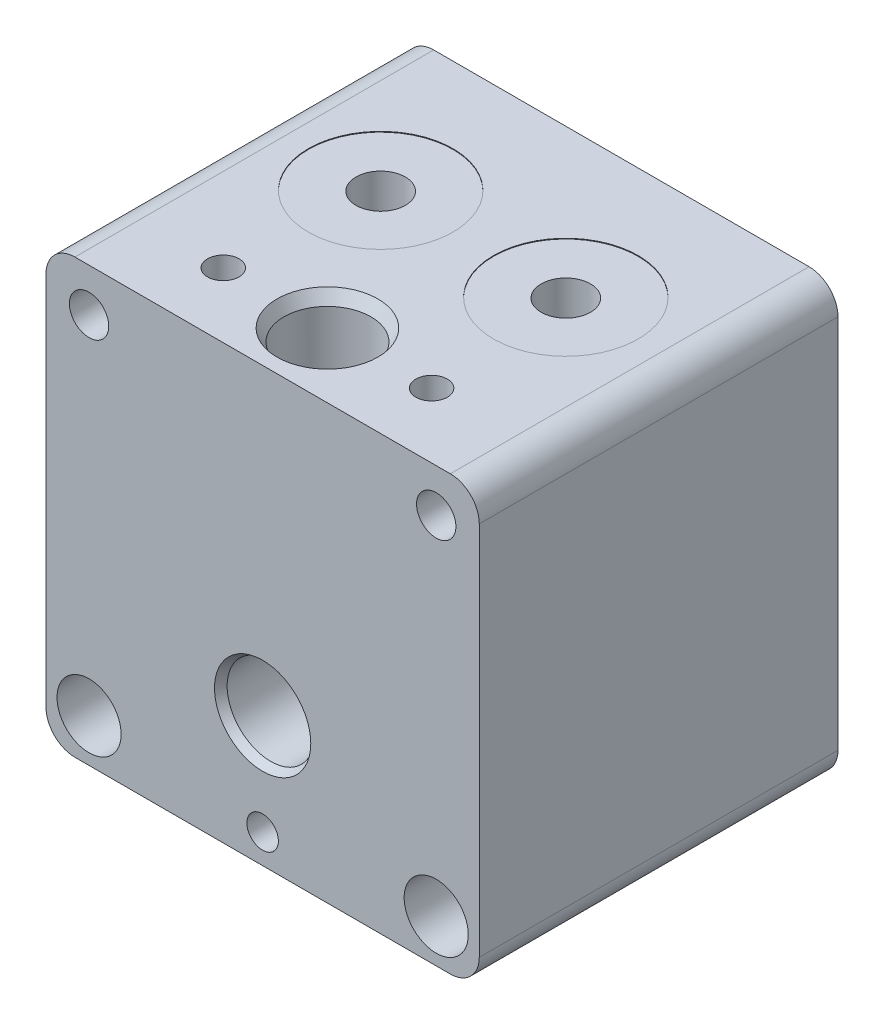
ISO-10303-21;
HEADER;
FILE_DESCRIPTION(('STEP AP214'),'2;1');
FILE_NAME('part.step','',(''),(''),'','','');
FILE_SCHEMA(('AUTOMOTIVE_DESIGN { 1 0 10303 214 1 1 1 1 }'));
ENDSEC;
DATA;
#1=APPLICATION_CONTEXT('core data for automotive mechanical design processes');
#2=APPLICATION_PROTOCOL_DEFINITION('international standard','automotive_design',2000,#1);
#3=PRODUCT_CONTEXT('',#1,'mechanical');
#4=PRODUCT('Part','Part','',(#3));
#5=PRODUCT_RELATED_PRODUCT_CATEGORY('part','',(#4));
#6=PRODUCT_DEFINITION_FORMATION('','',#4);
#7=PRODUCT_DEFINITION_CONTEXT('part definition',#1,'design');
#8=PRODUCT_DEFINITION('design','',#6,#7);
#9=PRODUCT_DEFINITION_SHAPE('','',#8);
#10=(LENGTH_UNIT() NAMED_UNIT(*) SI_UNIT(.MILLI.,.METRE.));
#11=(NAMED_UNIT(*) PLANE_ANGLE_UNIT() SI_UNIT($,.RADIAN.));
#12=(NAMED_UNIT(*) SI_UNIT($,.STERADIAN.) SOLID_ANGLE_UNIT());
#13=UNCERTAINTY_MEASURE_WITH_UNIT(LENGTH_MEASURE(1.E-05),#10,'distance_accuracy_value','');
#14=(GEOMETRIC_REPRESENTATION_CONTEXT(3) GLOBAL_UNCERTAINTY_ASSIGNED_CONTEXT((#13)) GLOBAL_UNIT_ASSIGNED_CONTEXT((#10,
#11,#12)) REPRESENTATION_CONTEXT('',''));
#15=CARTESIAN_POINT('',(0.,0.,0.));
#16=DIRECTION('',(0.,0.,1.));
#17=DIRECTION('',(1.,0.,0.));
#18=AXIS2_PLACEMENT_3D('',#15,#16,#17);
#19=CARTESIAN_POINT('',(0.,0.,12.7));
#20=DIRECTION('',(0.,0.,-1.));
#21=DIRECTION('',(-1.,0.,0.));
#22=AXIS2_PLACEMENT_3D('',#19,#20,#21);
#23=CYLINDRICAL_SURFACE('',#22,17.4625);
#24=CARTESIAN_POINT('',(0.,0.,4.68988181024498));
#25=DIRECTION('',(0.,0.,-1.));
#26=DIRECTION('',(-1.,0.,0.));
#27=AXIS2_PLACEMENT_3D('',#24,#25,#26);
#28=CIRCLE('',#27,17.4625);
#29=CARTESIAN_POINT('',(-17.4625,0.,4.68988181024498));
#30=VERTEX_POINT('',#29);
#31=EDGE_CURVE('E11',#30,#30,#28,.T.);
#32=ORIENTED_EDGE('',*,*,#31,.T.);
#33=EDGE_LOOP('',(#32));
#34=FACE_BOUND('',#33,.T.);
#35=CARTESIAN_POINT('',(0.,0.,12.7));
#36=DIRECTION('',(0.,0.,-1.));
#37=DIRECTION('',(-1.,0.,0.));
#38=AXIS2_PLACEMENT_3D('',#35,#36,#37);
#39=CIRCLE('',#38,17.4625);
#40=CARTESIAN_POINT('',(-17.4625,0.,12.7));
#41=VERTEX_POINT('',#40);
#42=EDGE_CURVE('E193',#41,#41,#39,.T.);
#43=ORIENTED_EDGE('',*,*,#42,.F.);
#44=EDGE_LOOP('',(#43));
#45=FACE_BOUND('',#44,.T.);
#46=ADVANCED_FACE('F35',(#34,#45),#23,.F.);
#47=CARTESIAN_POINT('',(0.,3.4544,32.258));
#48=DIRECTION('',(0.,1.,0.));
#49=DIRECTION('',(-1.,0.,0.));
#50=AXIS2_PLACEMENT_3D('',#47,#48,#49);
#51=CYLINDRICAL_SURFACE('',#50,2.413);
#52=CARTESIAN_POINT('',(-2.413,4.60350575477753,32.258));
#53=CARTESIAN_POINT('',(-2.41300384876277,4.60349766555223,32.3139977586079));
#54=CARTESIAN_POINT('',(-2.41104636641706,4.60579659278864,32.3699698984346));
#55=CARTESIAN_POINT('',(-2.40329389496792,4.61481059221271,32.4812969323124));
#56=CARTESIAN_POINT('',(-2.39749800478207,4.6215267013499,32.5366516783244));
#57=CARTESIAN_POINT('',(-2.37452643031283,4.64779766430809,32.701230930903));
#58=CARTESIAN_POINT('',(-2.3517677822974,4.67347267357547,32.8087423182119));
#59=CARTESIAN_POINT('',(-2.28722351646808,4.74269111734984,33.0378835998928));
#60=CARTESIAN_POINT('',(-2.24247550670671,4.78883240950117,33.1578324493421));
#61=CARTESIAN_POINT('',(-2.13665555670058,4.88961419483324,33.3863409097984));
#62=CARTESIAN_POINT('',(-2.07556237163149,4.94426571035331,33.4948854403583));
#63=CARTESIAN_POINT('',(-1.936711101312,5.05753950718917,33.7028949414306));
#64=CARTESIAN_POINT('',(-1.85859103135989,5.11622533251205,33.8020823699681));
#65=CARTESIAN_POINT('',(-1.68723666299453,5.23156414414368,33.9876589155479));
#66=CARTESIAN_POINT('',(-1.59401525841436,5.28821881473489,34.0740588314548));
#67=CARTESIAN_POINT('',(-1.39716607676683,5.39315208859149,34.2291748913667));
#68=CARTESIAN_POINT('',(-1.2941428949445,5.44168315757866,34.2984831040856));
#69=CARTESIAN_POINT('',(-1.07549217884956,5.52960954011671,34.4216940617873));
#70=CARTESIAN_POINT('',(-0.959867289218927,5.56900676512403,34.475600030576));
#71=CARTESIAN_POINT('',(-0.778268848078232,5.61878885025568,34.5429747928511));
#72=CARTESIAN_POINT('',(-0.716030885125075,5.63388429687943,34.5632552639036));
#73=CARTESIAN_POINT('',(-0.58941201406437,5.66047961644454,34.598828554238));
#74=CARTESIAN_POINT('',(-0.52503230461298,5.67198146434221,34.6141241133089));
#75=CARTESIAN_POINT('',(-0.394715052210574,5.6910564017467,34.6394217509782));
#76=CARTESIAN_POINT('',(-0.328778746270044,5.69863250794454,34.6494278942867));
#77=CARTESIAN_POINT('',(-0.195988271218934,5.70964684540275,34.6639563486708));
#78=CARTESIAN_POINT('',(-0.129134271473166,5.71308583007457,34.6684796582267));
#79=CARTESIAN_POINT('',(0.051184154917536,5.71660105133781,34.673109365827));
#80=CARTESIAN_POINT('',(0.164928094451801,5.71271037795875,34.6680023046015));
#81=CARTESIAN_POINT('',(0.389465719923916,5.69304234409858,34.6420485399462));
#82=CARTESIAN_POINT('',(0.500259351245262,5.67726476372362,34.6212015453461));
#83=CARTESIAN_POINT('',(0.712564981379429,5.63583787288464,34.5659166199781));
#84=CARTESIAN_POINT('',(0.814259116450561,5.6105137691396,34.5319255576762));
#85=CARTESIAN_POINT('',(1.01022655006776,5.55173516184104,34.4519070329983));
#86=CARTESIAN_POINT('',(1.10449854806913,5.51827923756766,34.4058774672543));
#87=CARTESIAN_POINT('',(1.2963855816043,5.44036167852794,34.2965553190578));
#88=CARTESIAN_POINT('',(1.39280110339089,5.39503040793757,34.2317864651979));
#89=CARTESIAN_POINT('',(1.57395461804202,5.29931376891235,34.0906076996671));
#90=CARTESIAN_POINT('',(1.65867875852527,5.24892252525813,34.0141842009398));
#91=CARTESIAN_POINT('',(1.83208498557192,5.13555011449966,33.8342906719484));
#92=CARTESIAN_POINT('',(1.91804120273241,5.07209961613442,33.7284845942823));
#93=CARTESIAN_POINT('',(2.07166543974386,4.94801586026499,33.5027533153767));
#94=CARTESIAN_POINT('',(2.13933686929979,4.88738207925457,33.382830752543));
#95=CARTESIAN_POINT('',(2.23852597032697,4.79232386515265,33.1644528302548));
#96=CARTESIAN_POINT('',(2.27486341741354,4.7553044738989,33.0693290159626));
#97=CARTESIAN_POINT('',(2.33575807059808,4.69100626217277,32.8723096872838));
#98=CARTESIAN_POINT('',(2.36034336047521,4.66370426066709,32.7704309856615));
#99=CARTESIAN_POINT('',(2.39332860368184,4.6264164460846,32.5781341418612));
#100=CARTESIAN_POINT('',(2.4036781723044,4.61436996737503,32.4884635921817));
#101=CARTESIAN_POINT('',(2.41418029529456,4.60214302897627,32.307743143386));
#102=CARTESIAN_POINT('',(2.41434122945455,4.60195281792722,32.2166944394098));
#103=CARTESIAN_POINT('',(2.40447669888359,4.61344242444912,32.0361140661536));
#104=CARTESIAN_POINT('',(2.39446905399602,4.62510147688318,31.9465800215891));
#105=CARTESIAN_POINT('',(2.36502018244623,4.65844014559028,31.7709600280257));
#106=CARTESIAN_POINT('',(2.34556334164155,4.68013634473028,31.6848800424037));
#107=CARTESIAN_POINT('',(2.28704796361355,4.7428649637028,31.4780230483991));
#108=CARTESIAN_POINT('',(2.24307446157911,4.78819256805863,31.3599599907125));
#109=CARTESIAN_POINT('',(2.13926887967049,4.88719282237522,31.1348168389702));
#110=CARTESIAN_POINT('',(2.07940154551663,4.94088391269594,31.0277619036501));
#111=CARTESIAN_POINT('',(1.94248178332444,5.05307238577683,30.8208890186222));
#112=CARTESIAN_POINT('',(1.86485638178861,5.11167523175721,30.7215084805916));
#113=CARTESIAN_POINT('',(1.69452086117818,5.22696847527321,30.5354871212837));
#114=CARTESIAN_POINT('',(1.60182266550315,5.28366034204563,30.4488363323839));
#115=CARTESIAN_POINT('',(1.40556091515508,5.3890279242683,30.2927836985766));
#116=CARTESIAN_POINT('',(1.30254084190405,5.43792571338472,30.2228534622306));
#117=CARTESIAN_POINT('',(1.08391773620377,5.52657218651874,30.0984961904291));
#118=CARTESIAN_POINT('',(0.968326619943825,5.56632942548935,30.0440546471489));
#119=CARTESIAN_POINT('',(0.74482079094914,5.62824129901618,29.9602079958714));
#120=CARTESIAN_POINT('',(0.638342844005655,5.65213912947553,29.9282764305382));
#121=CARTESIAN_POINT('',(0.420195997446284,5.68901056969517,29.8792448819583));
#122=CARTESIAN_POINT('',(0.30853042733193,5.70199108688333,29.8621355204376));
#123=CARTESIAN_POINT('',(0.0828219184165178,5.71593786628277,29.8437585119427));
#124=CARTESIAN_POINT('',(-0.0312267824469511,5.71687051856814,29.8425351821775));
#125=CARTESIAN_POINT('',(-0.257805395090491,5.70654814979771,29.8561277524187));
#126=CARTESIAN_POINT('',(-0.370335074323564,5.69529128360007,29.8709460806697));
#127=CARTESIAN_POINT('',(-0.585939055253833,5.66229262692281,29.9147435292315));
#128=CARTESIAN_POINT('',(-0.689211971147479,5.64100791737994,29.9431059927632));
#129=CARTESIAN_POINT('',(-0.889151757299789,5.58970488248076,30.0122971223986));
#130=CARTESIAN_POINT('',(-0.985817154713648,5.55968461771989,30.0531285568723));
#131=CARTESIAN_POINT('',(-1.18085626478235,5.48924603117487,30.1505726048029));
#132=CARTESIAN_POINT('',(-1.27834844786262,5.44806795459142,30.2083901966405));
#133=CARTESIAN_POINT('',(-1.46261071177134,5.35990227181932,30.3355298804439));
#134=CARTESIAN_POINT('',(-1.54937228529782,5.31291011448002,30.4048609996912));
#135=CARTESIAN_POINT('',(-1.72784395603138,5.20608820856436,30.568454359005));
#136=CARTESIAN_POINT('',(-1.81710691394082,5.145563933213,30.6649326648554));
#137=CARTESIAN_POINT('',(-1.97904956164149,5.02478929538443,30.8712230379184));
#138=CARTESIAN_POINT('',(-2.05171850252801,4.9645391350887,30.9810436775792));
#139=CARTESIAN_POINT('',(-2.16807568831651,4.8605701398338,31.1931278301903));
#140=CARTESIAN_POINT('',(-2.21461451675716,4.81580945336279,31.2933106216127));
#141=CARTESIAN_POINT('',(-2.29431930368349,4.73543374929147,31.5022847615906));
#142=CARTESIAN_POINT('',(-2.32751489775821,4.69979852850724,31.6110563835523));
#143=CARTESIAN_POINT('',(-2.37259631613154,4.6500406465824,31.8095151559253));
#144=CARTESIAN_POINT('',(-2.38765491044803,4.63283199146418,31.8976903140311));
#145=CARTESIAN_POINT('',(-2.40784600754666,4.6095796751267,32.0766021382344));
#146=CARTESIAN_POINT('',(-2.41299376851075,4.60351885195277,32.1673346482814));
#147=CARTESIAN_POINT('',(-2.413,4.60350575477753,32.258));
#148=B_SPLINE_CURVE_WITH_KNOTS('',3,(#52,#53,#54,#55,#56,#57,#58,#59,#60,#61,#62,#63,#64,#65,
#66,#67,#68,#69,#70,#71,#72,#73,#74,#75,#76,#77,#78,#79,#80,#81,#82,#83,#84,#85,#86,#87,#88,#89,
#90,#91,#92,#93,#94,#95,#96,#97,#98,#99,#100,#101,#102,#103,#104,#105,#106,#107,#108,#109,#110,
#111,#112,#113,#114,#115,#116,#117,#118,#119,#120,#121,#122,#123,#124,#125,#126,#127,#128,#129,
#130,#131,#132,#133,#134,#135,#136,#137,#138,#139,#140,#141,#142,#143,#144,#145,#146,#147),
.UNSPECIFIED.,.T.,.F.,(4,2,2,2,2,2,2,2,2,2,2,2,2,2,2,2,2,2,2,2,2,2,2,2,2,2,2,2,2,2,2,2,2,2,2,2,
2,2,2,2,2,2,2,2,2,2,2,4),(0.,0.167865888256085,0.335771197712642,0.672253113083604,
1.07835156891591,1.48498044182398,1.90128606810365,2.3172380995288,2.71564984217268,
3.11397813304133,3.31524451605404,3.5164000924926,3.71740086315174,3.91836502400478,
4.25822516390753,4.59809159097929,4.92729627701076,5.25655852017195,5.6292558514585,
6.00239104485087,6.45173609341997,6.90099729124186,7.22505308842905,7.54833057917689,
7.820296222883,8.09203818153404,8.36330474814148,8.63502109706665,9.03448223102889,
9.43483692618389,9.85060800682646,10.2660517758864,10.6657843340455,11.0651412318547,
11.4047809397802,11.7442055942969,12.0845769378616,12.4249998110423,12.7512185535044,
13.0775097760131,13.437976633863,13.7987274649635,14.2312195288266,14.6639909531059,
15.020469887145,15.376152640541,15.6483618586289,15.9201516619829),.UNSPECIFIED.);
#149=CARTESIAN_POINT('',(-2.413,4.60350575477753,32.258));
#150=VERTEX_POINT('',#149);
#151=EDGE_CURVE('E210',#150,#150,#148,.T.);
#152=ORIENTED_EDGE('',*,*,#151,.F.);
#153=EDGE_LOOP('',(#152));
#154=FACE_BOUND('',#153,.T.);
#155=CARTESIAN_POINT('',(0.,10.0584,32.258));
#156=DIRECTION('',(0.,1.,0.));
#157=DIRECTION('',(-1.,0.,0.));
#158=AXIS2_PLACEMENT_3D('',#155,#156,#157);
#159=CIRCLE('',#158,2.413);
#160=CARTESIAN_POINT('',(-2.413,10.0584,32.258));
#161=VERTEX_POINT('',#160);
#162=EDGE_CURVE('E218',#161,#161,#159,.F.);
#163=ORIENTED_EDGE('',*,*,#162,.F.);
#164=EDGE_LOOP('',(#163));
#165=FACE_BOUND('',#164,.T.);
#166=ADVANCED_FACE('F224',(#154,#165),#51,.F.);
#167=CARTESIAN_POINT('',(10.16,0.914399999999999,16.256));
#168=DIRECTION('',(0.,1.,0.));
#169=DIRECTION('',(-1.,0.,0.));
#170=AXIS2_PLACEMENT_3D('',#167,#168,#169);
#171=CYLINDRICAL_SURFACE('',#170,2.7051);
#172=CARTESIAN_POINT('',(7.4549,15.7209944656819,16.256));
#173=CARTESIAN_POINT('',(7.45490816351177,15.7209922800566,16.3959260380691));
#174=CARTESIAN_POINT('',(7.46581909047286,15.715830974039,16.5360538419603));
#175=CARTESIAN_POINT('',(7.5090302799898,15.6952290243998,16.812384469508));
#176=CARTESIAN_POINT('',(7.54137675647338,15.6797661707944,16.9485781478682));
#177=CARTESIAN_POINT('',(7.62594426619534,15.6388094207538,17.2127136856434));
#178=CARTESIAN_POINT('',(7.6781209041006,15.6133379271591,17.3406732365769));
#179=CARTESIAN_POINT('',(7.80008511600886,15.5527645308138,17.5853058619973));
#180=CARTESIAN_POINT('',(7.8698656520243,15.5176664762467,17.7019834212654));
#181=CARTESIAN_POINT('',(8.02643011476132,15.4372780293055,17.9246785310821));
#182=CARTESIAN_POINT('',(8.11363695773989,15.3917288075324,18.0303041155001));
#183=CARTESIAN_POINT('',(8.30039050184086,15.2918255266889,18.2251758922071));
#184=CARTESIAN_POINT('',(8.39994134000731,15.2374685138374,18.3144165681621));
#185=CARTESIAN_POINT('',(8.61704056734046,15.1158382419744,18.4824946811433));
#186=CARTESIAN_POINT('',(8.73540086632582,15.0478545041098,18.5597649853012));
#187=CARTESIAN_POINT('',(8.97877596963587,14.903919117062,18.6935375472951));
#188=CARTESIAN_POINT('',(9.10379380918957,14.8279638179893,18.7500302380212));
#189=CARTESIAN_POINT('',(9.37374939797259,14.6590091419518,18.8488086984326));
#190=CARTESIAN_POINT('',(9.51914446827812,14.5650819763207,18.8882486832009));
#191=CARTESIAN_POINT('',(9.81011387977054,14.3707189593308,18.9424631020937));
#192=CARTESIAN_POINT('',(9.9556882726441,14.2702801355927,18.9572261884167));
#193=CARTESIAN_POINT('',(10.2673421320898,14.0480997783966,18.9641548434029));
#194=CARTESIAN_POINT('',(10.4329303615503,13.925540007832,18.9522797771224));
#195=CARTESIAN_POINT('',(10.7568011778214,13.6769251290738,18.8995546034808));
#196=CARTESIAN_POINT('',(10.9150753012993,13.5508662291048,18.8586717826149));
#197=CARTESIAN_POINT('',(11.2434872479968,13.280079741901,18.7415982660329));
#198=CARTESIAN_POINT('',(11.4120884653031,13.1352585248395,18.6611969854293));
#199=CARTESIAN_POINT('',(11.6518873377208,12.9216989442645,18.5144547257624));
#200=CARTESIAN_POINT('',(11.7296561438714,12.8511054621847,18.4611655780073));
#201=CARTESIAN_POINT('',(11.8803030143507,12.7119661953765,18.3457654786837));
#202=CARTESIAN_POINT('',(11.9531829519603,12.6434196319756,18.283657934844));
#203=CARTESIAN_POINT('',(12.1230575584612,12.4810127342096,18.1222614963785));
#204=CARTESIAN_POINT('',(12.2172225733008,12.3887008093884,18.0183535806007));
#205=CARTESIAN_POINT('',(12.3914441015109,12.2144357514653,17.791767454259));
#206=CARTESIAN_POINT('',(12.4715256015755,12.1324643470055,17.6691232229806));
#207=CARTESIAN_POINT('',(12.5956452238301,12.0033677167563,17.4382708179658));
#208=CARTESIAN_POINT('',(12.6436790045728,11.9526694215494,17.3342325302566));
#209=CARTESIAN_POINT('',(12.7272959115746,11.8635946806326,17.1163021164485));
#210=CARTESIAN_POINT('',(12.7628963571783,11.8252011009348,17.0024239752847));
#211=CARTESIAN_POINT('',(12.8148753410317,11.76883274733,16.7848959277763));
#212=CARTESIAN_POINT('',(12.8333564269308,11.7486378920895,16.6823320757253));
#213=CARTESIAN_POINT('',(12.8583321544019,11.7212990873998,16.4740481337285));
#214=CARTESIAN_POINT('',(12.8648345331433,11.714146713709,16.3683301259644));
#215=CARTESIAN_POINT('',(12.8653497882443,11.7135808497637,16.1566956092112));
#216=CARTESIAN_POINT('',(12.8593470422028,11.7201845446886,16.0507790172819));
#217=CARTESIAN_POINT('',(12.8352992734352,11.7465143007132,15.8419948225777));
#218=CARTESIAN_POINT('',(12.817248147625,11.7662470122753,15.7391287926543));
#219=CARTESIAN_POINT('',(12.7704246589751,11.8170480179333,15.5392232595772));
#220=CARTESIAN_POINT('',(12.7416854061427,11.8480812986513,15.4421668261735));
#221=CARTESIAN_POINT('',(12.6750109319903,11.9193828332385,15.2549087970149));
#222=CARTESIAN_POINT('',(12.6370713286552,11.9596554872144,15.1647104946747));
#223=CARTESIAN_POINT('',(12.5291311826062,12.0729105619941,14.9415263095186));
#224=CARTESIAN_POINT('',(12.4533038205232,12.1513103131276,14.8140955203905));
#225=CARTESIAN_POINT('',(12.286698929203,12.319755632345,14.5779941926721));
#226=CARTESIAN_POINT('',(12.1958801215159,12.4098332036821,14.4693771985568));
#227=CARTESIAN_POINT('',(11.9686742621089,12.6296801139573,14.2357872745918));
#228=CARTESIAN_POINT('',(11.8274267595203,12.7623550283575,14.1182723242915));
#229=CARTESIAN_POINT('',(11.5283150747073,13.0331896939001,13.9154986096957));
#230=CARTESIAN_POINT('',(11.3704437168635,13.1713517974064,13.8302538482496));
#231=CARTESIAN_POINT('',(11.039145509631,13.4502770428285,13.6913668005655));
#232=CARTESIAN_POINT('',(10.8655283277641,13.5910491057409,13.6381943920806));
#233=CARTESIAN_POINT('',(10.5083847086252,13.8690427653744,13.5672500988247));
#234=CARTESIAN_POINT('',(10.3248553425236,14.0062632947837,13.549488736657));
#235=CARTESIAN_POINT('',(9.94443368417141,14.2790119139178,13.5525440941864));
#236=CARTESIAN_POINT('',(9.74730451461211,14.4142229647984,13.5750242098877));
#237=CARTESIAN_POINT('',(9.45350261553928,14.6072034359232,13.6428519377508));
#238=CARTESIAN_POINT('',(9.35590986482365,14.6698754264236,13.6711336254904));
#239=CARTESIAN_POINT('',(9.16251450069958,14.7914341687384,13.739436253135));
#240=CARTESIAN_POINT('',(9.06671106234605,14.8503226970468,13.7794516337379));
#241=CARTESIAN_POINT('',(8.84100963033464,14.9861684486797,13.8897305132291));
#242=CARTESIAN_POINT('',(8.71259987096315,15.0610693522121,13.9656983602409));
#243=CARTESIAN_POINT('',(8.46663613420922,15.2006995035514,14.1410927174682));
#244=CARTESIAN_POINT('',(8.34907493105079,15.265435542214,14.2405034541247));
#245=CARTESIAN_POINT('',(8.18448316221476,15.3539373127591,14.4063925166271));
#246=CARTESIAN_POINT('',(8.13142039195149,15.3820835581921,14.4647073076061));
#247=CARTESIAN_POINT('',(8.02999747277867,15.4352715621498,14.5865906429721));
#248=CARTESIAN_POINT('',(7.98163521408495,15.4603147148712,14.6501568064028));
#249=CARTESIAN_POINT('',(7.89022994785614,15.5071633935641,14.782174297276));
#250=CARTESIAN_POINT('',(7.84718962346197,15.5289672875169,14.8506280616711));
#251=CARTESIAN_POINT('',(7.76706474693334,15.5691976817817,14.9918734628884));
#252=CARTESIAN_POINT('',(7.72997930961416,15.5876246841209,15.064664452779));
#253=CARTESIAN_POINT('',(7.66576155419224,15.6192973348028,15.2063524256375));
#254=CARTESIAN_POINT('',(7.6379999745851,15.6328796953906,15.2748898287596));
#255=CARTESIAN_POINT('',(7.58806193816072,15.6571801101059,15.4144585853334));
#256=CARTESIAN_POINT('',(7.5658848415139,15.667898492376,15.4854896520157));
#257=CARTESIAN_POINT('',(7.52744075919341,15.686404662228,15.6293207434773));
#258=CARTESIAN_POINT('',(7.51115982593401,15.694199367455,15.7021161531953));
#259=CARTESIAN_POINT('',(7.4846501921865,15.7068593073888,15.8490170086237));
#260=CARTESIAN_POINT('',(7.47441793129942,15.7117262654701,15.9231216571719));
#261=CARTESIAN_POINT('',(7.4631536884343,15.7170785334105,16.040488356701));
#262=CARTESIAN_POINT('',(7.46006051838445,15.7185465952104,16.0835184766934));
#263=CARTESIAN_POINT('',(7.45593241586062,15.7205048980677,16.1696926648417));
#264=CARTESIAN_POINT('',(7.45489748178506,15.7209951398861,16.212836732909));
#265=CARTESIAN_POINT('',(7.4549,15.7209944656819,16.256));
#266=B_SPLINE_CURVE_WITH_KNOTS('',3,(#172,#173,#174,#175,#176,#177,#178,#179,#180,#181,#182,
#183,#184,#185,#186,#187,#188,#189,#190,#191,#192,#193,#194,#195,#196,#197,#198,#199,#200,#201,
#202,#203,#204,#205,#206,#207,#208,#209,#210,#211,#212,#213,#214,#215,#216,#217,#218,#219,#220,
#221,#222,#223,#224,#225,#226,#227,#228,#229,#230,#231,#232,#233,#234,#235,#236,#237,#238,#239,
#240,#241,#242,#243,#244,#245,#246,#247,#248,#249,#250,#251,#252,#253,#254,#255,#256,#257,#258,
#259,#260,#261,#262,#263,#264,#265),.UNSPECIFIED.,.T.,.F.,(4,2,2,2,2,2,2,2,2,2,2,2,2,2,2,2,2,2,
2,2,2,2,2,2,2,2,2,2,2,2,2,2,2,2,2,2,2,2,2,2,2,2,2,2,2,2,4),(0.,0.419615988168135,
0.840139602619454,1.25972725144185,1.6791474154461,2.11036035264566,2.54171820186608,
3.01038068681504,3.47925869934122,4.00980528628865,4.54059578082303,5.15722687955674,
5.77455449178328,6.48009648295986,6.83306257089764,7.18589263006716,7.68787437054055,
8.1889563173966,8.56356092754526,8.93764162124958,9.25471347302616,9.57158045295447,
9.88884352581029,10.2062674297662,10.5227160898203,10.8393157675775,11.3396925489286,
11.841470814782,12.5178331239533,13.1944885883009,13.8808307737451,14.567376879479,
15.2829598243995,15.6405596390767,15.9979902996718,16.4966735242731,16.9950221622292,
17.2458762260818,17.4966171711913,17.7474840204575,17.9983135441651,18.223571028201,
18.4488026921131,18.6734980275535,18.8980609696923,19.0275008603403,19.1569406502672),.UNSPECIFIED.);
#267=CARTESIAN_POINT('',(7.4549,15.7209944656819,16.256));
#268=VERTEX_POINT('',#267);
#269=EDGE_CURVE('E208',#268,#268,#266,.T.);
#270=ORIENTED_EDGE('',*,*,#269,.F.);
#271=EDGE_LOOP('',(#270));
#272=FACE_BOUND('',#271,.T.);
#273=CARTESIAN_POINT('',(10.16,23.6982,16.256));
#274=DIRECTION('',(0.,1.,0.));
#275=DIRECTION('',(-1.,0.,0.));
#276=AXIS2_PLACEMENT_3D('',#273,#274,#275);
#277=CIRCLE('',#276,2.7051);
#278=CARTESIAN_POINT('',(7.4549,23.6982,16.256));
#279=VERTEX_POINT('',#278);
#280=EDGE_CURVE('E205',#279,#279,#277,.F.);
#281=ORIENTED_EDGE('',*,*,#280,.F.);
#282=EDGE_LOOP('',(#281));
#283=FACE_BOUND('',#282,.T.);
#284=ADVANCED_FACE('F229',(#272,#283),#171,.F.);
#285=CARTESIAN_POINT('',(-10.16,0.914399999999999,16.256));
#286=DIRECTION('',(0.,1.,0.));
#287=DIRECTION('',(-1.,0.,0.));
#288=AXIS2_PLACEMENT_3D('',#285,#286,#287);
#289=CYLINDRICAL_SURFACE('',#288,2.7051);
#290=CARTESIAN_POINT('',(-12.8651,11.7138551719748,16.256));
#291=CARTESIAN_POINT('',(-12.8650997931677,11.7138554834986,16.3756578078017));
#292=CARTESIAN_POINT('',(-12.8570892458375,11.7226712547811,16.4953171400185));
#293=CARTESIAN_POINT('',(-12.825851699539,11.7568378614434,16.7302152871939));
#294=CARTESIAN_POINT('',(-12.8026094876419,11.7822052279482,16.8454495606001));
#295=CARTESIAN_POINT('',(-12.7431369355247,11.8464985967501,17.0672070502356));
#296=CARTESIAN_POINT('',(-12.7070231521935,11.8853028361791,17.1737982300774));
#297=CARTESIAN_POINT('',(-12.6239564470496,11.9734958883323,17.3778947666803));
#298=CARTESIAN_POINT('',(-12.5769977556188,12.0228903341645,17.4753952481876));
#299=CARTESIAN_POINT('',(-12.4483124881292,12.1563561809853,17.7074024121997));
#300=CARTESIAN_POINT('',(-12.3609631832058,12.245391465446,17.8359306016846));
#301=CARTESIAN_POINT('',(-12.1708202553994,12.4344060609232,18.071823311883));
#302=CARTESIAN_POINT('',(-12.067989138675,12.5344117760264,18.179134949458));
#303=CARTESIAN_POINT('',(-11.8164785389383,12.7724067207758,18.4031041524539));
#304=CARTESIAN_POINT('',(-11.6634224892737,12.9126217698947,18.5124935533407));
#305=CARTESIAN_POINT('',(-11.3409635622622,13.1967448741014,18.6967753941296));
#306=CARTESIAN_POINT('',(-11.1715514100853,13.3406549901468,18.7716481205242));
#307=CARTESIAN_POINT('',(-10.8185451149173,13.6285211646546,18.8863254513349));
#308=CARTESIAN_POINT('',(-10.6348386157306,13.7724663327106,18.9258134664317));
#309=CARTESIAN_POINT('',(-10.2590459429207,14.0546138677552,18.9658631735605));
#310=CARTESIAN_POINT('',(-10.0669701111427,14.1928229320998,18.9664716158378));
#311=CARTESIAN_POINT('',(-9.71507315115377,14.435367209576,18.9290280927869));
#312=CARTESIAN_POINT('',(-9.5556363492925,14.5413359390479,18.8978806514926));
#313=CARTESIAN_POINT('',(-9.2395769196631,14.7441683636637,18.8050045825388));
#314=CARTESIAN_POINT('',(-9.08295358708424,14.8410343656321,18.7432837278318));
#315=CARTESIAN_POINT('',(-8.85431644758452,14.9777958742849,18.6266943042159));
#316=CARTESIAN_POINT('',(-8.77882182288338,15.0221437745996,18.583575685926));
#317=CARTESIAN_POINT('',(-8.63106717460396,15.1075188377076,18.4892924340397));
#318=CARTESIAN_POINT('',(-8.55880543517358,15.1485477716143,18.438132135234));
#319=CARTESIAN_POINT('',(-8.4185105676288,15.226961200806,18.3278927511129));
#320=CARTESIAN_POINT('',(-8.35047587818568,15.2643470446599,18.2688166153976));
#321=CARTESIAN_POINT('',(-8.21964142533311,15.3351957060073,18.1430095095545));
#322=CARTESIAN_POINT('',(-8.15684058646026,15.3686593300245,18.0762801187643));
#323=CARTESIAN_POINT('',(-8.04606930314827,15.4269021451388,17.9457065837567));
#324=CARTESIAN_POINT('',(-7.9972630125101,15.452238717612,17.8828179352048));
#325=CARTESIAN_POINT('',(-7.90490378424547,15.4996900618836,17.7521636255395));
#326=CARTESIAN_POINT('',(-7.86134996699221,15.521805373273,17.6843987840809));
#327=CARTESIAN_POINT('',(-7.78012382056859,15.5626779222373,17.5445216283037));
#328=CARTESIAN_POINT('',(-7.74244784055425,15.5814372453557,17.472412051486));
#329=CARTESIAN_POINT('',(-7.67350359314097,15.6155056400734,17.3244449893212));
#330=CARTESIAN_POINT('',(-7.64223465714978,15.6308150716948,17.2485878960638));
#331=CARTESIAN_POINT('',(-7.56539251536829,15.6682181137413,17.0347884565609));
#332=CARTESIAN_POINT('',(-7.52702309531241,15.6866179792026,16.8934989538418));
#333=CARTESIAN_POINT('',(-7.4736054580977,15.7121391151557,16.6056947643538));
#334=CARTESIAN_POINT('',(-7.45854760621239,15.7192650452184,16.4591822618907));
#335=CARTESIAN_POINT('',(-7.45259565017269,15.722086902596,16.1736398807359));
#336=CARTESIAN_POINT('',(-7.46041763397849,15.7183901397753,16.0346418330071));
#337=CARTESIAN_POINT('',(-7.49713449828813,15.7009102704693,15.76012953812));
#338=CARTESIAN_POINT('',(-7.52602697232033,15.6871283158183,15.6246148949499));
#339=CARTESIAN_POINT('',(-7.60340231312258,15.6497696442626,15.3615279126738));
#340=CARTESIAN_POINT('',(-7.65178232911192,15.626244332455,15.2339178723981));
#341=CARTESIAN_POINT('',(-7.76609206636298,15.5697482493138,14.9891023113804));
#342=CARTESIAN_POINT('',(-7.83202341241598,15.5367766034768,14.8718977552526));
#343=CARTESIAN_POINT('',(-7.98157746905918,15.4604948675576,14.6463327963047));
#344=CARTESIAN_POINT('',(-8.0657682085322,15.4168451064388,14.5384651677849));
#345=CARTESIAN_POINT('',(-8.24697444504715,15.320676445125,14.3386823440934));
#346=CARTESIAN_POINT('',(-8.34399336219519,15.268155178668,14.2467714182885));
#347=CARTESIAN_POINT('',(-8.55588307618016,15.1505079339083,14.0731963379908));
#348=CARTESIAN_POINT('',(-8.67156512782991,15.0847020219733,13.9929872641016));
#349=CARTESIAN_POINT('',(-8.9101330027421,14.9450281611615,13.8529687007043));
#350=CARTESIAN_POINT('',(-9.03302201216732,14.8711566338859,13.7931683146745));
#351=CARTESIAN_POINT('',(-9.29852592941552,14.7067995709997,13.6872697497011));
#352=CARTESIAN_POINT('',(-9.44165620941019,14.6153970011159,13.6438956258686));
#353=CARTESIAN_POINT('',(-9.72872730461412,14.4259046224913,13.5814564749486));
#354=CARTESIAN_POINT('',(-9.87266847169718,14.3278116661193,13.5624029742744));
#355=CARTESIAN_POINT('',(-10.1812189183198,14.1105984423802,13.5458970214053));
#356=CARTESIAN_POINT('',(-10.3454414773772,13.9906285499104,13.5523980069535));
#357=CARTESIAN_POINT('',(-10.6673411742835,13.7467788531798,13.5939411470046));
#358=CARTESIAN_POINT('',(-10.8250115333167,13.6228952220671,13.6290121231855));
#359=CARTESIAN_POINT('',(-11.1536564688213,13.3556108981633,13.7332639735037));
#360=CARTESIAN_POINT('',(-11.3231421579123,13.2120374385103,13.8067279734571));
#361=CARTESIAN_POINT('',(-11.6460022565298,12.9283376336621,13.9880378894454));
#362=CARTESIAN_POINT('',(-11.7993805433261,12.788210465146,14.0958755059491));
#363=CARTESIAN_POINT('',(-12.049667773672,12.5519953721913,14.3151079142));
#364=CARTESIAN_POINT('',(-12.1511163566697,12.4536447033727,14.4188976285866));
#365=CARTESIAN_POINT('',(-12.3394342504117,12.2670699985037,14.6468331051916));
#366=CARTESIAN_POINT('',(-12.4263305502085,12.1788273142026,14.770940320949));
#367=CARTESIAN_POINT('',(-12.5605733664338,12.0400966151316,15.0039082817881));
#368=CARTESIAN_POINT('',(-12.6122831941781,11.9858211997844,15.1079795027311));
#369=CARTESIAN_POINT('',(-12.7032307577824,11.8893868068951,15.3267375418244));
#370=CARTESIAN_POINT('',(-12.7424811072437,11.8472155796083,15.441413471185));
#371=CARTESIAN_POINT('',(-12.8035798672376,11.7811482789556,15.6710760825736));
#372=CARTESIAN_POINT('',(-12.8264634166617,11.7561698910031,15.7854661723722));
#373=CARTESIAN_POINT('',(-12.8572159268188,11.7225315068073,16.0185733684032));
#374=CARTESIAN_POINT('',(-12.865100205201,11.7138548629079,16.1372859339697));
#375=CARTESIAN_POINT('',(-12.8651,11.7138551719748,16.256));
#376=B_SPLINE_CURVE_WITH_KNOTS('',3,(#290,#291,#292,#293,#294,#295,#296,#297,#298,#299,#300,
#301,#302,#303,#304,#305,#306,#307,#308,#309,#310,#311,#312,#313,#314,#315,#316,#317,#318,#319,
#320,#321,#322,#323,#324,#325,#326,#327,#328,#329,#330,#331,#332,#333,#334,#335,#336,#337,#338,
#339,#340,#341,#342,#343,#344,#345,#346,#347,#348,#349,#350,#351,#352,#353,#354,#355,#356,#357,
#358,#359,#360,#361,#362,#363,#364,#365,#366,#367,#368,#369,#370,#371,#372,#373,#374,#375),
.UNSPECIFIED.,.T.,.F.,(4,2,2,2,2,2,2,2,2,2,2,2,2,2,2,2,2,2,2,2,2,2,2,2,2,2,2,2,2,2,2,2,2,2,2,2,
2,2,2,2,2,2,4),(0.,0.358425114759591,0.717208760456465,1.0728227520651,1.42862637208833,
1.96295626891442,2.49860166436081,3.19891122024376,3.89962024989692,4.60653772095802,
5.31260515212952,5.89221660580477,6.47168077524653,6.76411073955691,7.05638360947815,
7.34854787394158,7.64065195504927,7.89092143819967,8.14114895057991,8.3912204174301,
8.64126577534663,9.0814516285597,9.52145550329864,9.93725025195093,10.3529975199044,
10.7665787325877,11.1801982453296,11.6092415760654,12.0383995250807,12.5026947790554,
12.9671968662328,13.4910014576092,14.0150542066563,14.6231351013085,15.2318301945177,
15.9306905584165,16.6293823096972,17.1536939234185,17.6770220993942,18.060489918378,
18.4435682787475,18.7995302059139,19.1551284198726),.UNSPECIFIED.);
#377=CARTESIAN_POINT('',(-12.8651,11.7138551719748,16.256));
#378=VERTEX_POINT('',#377);
#379=EDGE_CURVE('E203',#378,#378,#376,.T.);
#380=ORIENTED_EDGE('',*,*,#379,.F.);
#381=EDGE_LOOP('',(#380));
#382=FACE_BOUND('',#381,.T.);
#383=CARTESIAN_POINT('',(-10.16,23.6982,16.256));
#384=DIRECTION('',(0.,1.,0.));
#385=DIRECTION('',(-1.,0.,0.));
#386=AXIS2_PLACEMENT_3D('',#383,#384,#385);
#387=CIRCLE('',#386,2.7051);
#388=CARTESIAN_POINT('',(-12.8651,23.6982,16.256));
#389=VERTEX_POINT('',#388);
#390=EDGE_CURVE('E200',#389,#389,#387,.F.);
#391=ORIENTED_EDGE('',*,*,#390,.F.);
#392=EDGE_LOOP('',(#391));
#393=FACE_BOUND('',#392,.T.);
#394=ADVANCED_FACE('F261',(#382,#393),#289,.F.);
#395=CARTESIAN_POINT('',(0.,0.,22.352));
#396=DIRECTION('',(0.,0.,-1.));
#397=DIRECTION('',(-1.,0.,0.));
#398=AXIS2_PLACEMENT_3D('',#395,#396,#397);
#399=CYLINDRICAL_SURFACE('',#398,17.399);
#400=ORIENTED_EDGE('',*,*,#269,.T.);
#401=EDGE_LOOP('',(#400));
#402=FACE_BOUND('',#401,.T.);
#403=ORIENTED_EDGE('',*,*,#379,.T.);
#404=EDGE_LOOP('',(#403));
#405=FACE_BOUND('',#404,.T.);
#406=CARTESIAN_POINT('',(0.,0.,22.352));
#407=DIRECTION('',(0.,0.,-1.));
#408=DIRECTION('',(-1.,0.,0.));
#409=AXIS2_PLACEMENT_3D('',#406,#407,#408);
#410=CIRCLE('',#409,17.399);
#411=CARTESIAN_POINT('',(-17.399,0.,22.352));
#412=VERTEX_POINT('',#411);
#413=EDGE_CURVE('E189',#412,#412,#410,.T.);
#414=ORIENTED_EDGE('',*,*,#413,.F.);
#415=EDGE_LOOP('',(#414));
#416=FACE_BOUND('',#415,.T.);
#417=CARTESIAN_POINT('',(0.,0.,12.7));
#418=DIRECTION('',(0.,0.,-1.));
#419=DIRECTION('',(-1.,0.,0.));
#420=AXIS2_PLACEMENT_3D('',#417,#418,#419);
#421=CIRCLE('',#420,17.399);
#422=CARTESIAN_POINT('',(-17.399,0.,12.7));
#423=VERTEX_POINT('',#422);
#424=EDGE_CURVE('E190',#423,#423,#421,.F.);
#425=ORIENTED_EDGE('',*,*,#424,.F.);
#426=EDGE_LOOP('',(#425));
#427=FACE_BOUND('',#426,.T.);
#428=ADVANCED_FACE('F273',(#402,#405,#416,#427),#399,.F.);
#429=CARTESIAN_POINT('',(0.,-9.525,0.));
#430=DIRECTION('',(0.,0.,1.));
#431=DIRECTION('',(1.,0.,0.));
#432=AXIS2_PLACEMENT_3D('',#429,#430,#431);
#433=CYLINDRICAL_SURFACE('',#432,3.2385);
#434=CARTESIAN_POINT('',(0.,-9.525,27.686));
#435=DIRECTION('',(0.,0.,1.));
#436=DIRECTION('',(1.,0.,0.));
#437=AXIS2_PLACEMENT_3D('',#434,#435,#436);
#438=CIRCLE('',#437,3.2385);
#439=CARTESIAN_POINT('',(3.2385,-9.525,27.686));
#440=VERTEX_POINT('',#439);
#441=EDGE_CURVE('E181',#440,#440,#438,.F.);
#442=ORIENTED_EDGE('',*,*,#441,.F.);
#443=EDGE_LOOP('',(#442));
#444=FACE_BOUND('',#443,.T.);
#445=CARTESIAN_POINT('',(0.,-9.525,22.352));
#446=DIRECTION('',(0.,0.,-1.));
#447=DIRECTION('',(-1.,0.,0.));
#448=AXIS2_PLACEMENT_3D('',#445,#446,#447);
#449=CIRCLE('',#448,3.2385);
#450=CARTESIAN_POINT('',(-3.2385,-9.525,22.352));
#451=VERTEX_POINT('',#450);
#452=EDGE_CURVE('E186',#451,#451,#449,.F.);
#453=ORIENTED_EDGE('',*,*,#452,.F.);
#454=EDGE_LOOP('',(#453));
#455=FACE_BOUND('',#454,.T.);
#456=ADVANCED_FACE('F278',(#444,#455),#433,.F.);
#457=CARTESIAN_POINT('',(-19.05,-19.05,0.));
#458=DIRECTION('',(0.,0.,1.));
#459=DIRECTION('',(1.,0.,0.));
#460=AXIS2_PLACEMENT_3D('',#457,#458,#459);
#461=CYLINDRICAL_SURFACE('',#460,2.159);
#462=CARTESIAN_POINT('',(-19.05,-19.05,0.));
#463=DIRECTION('',(0.,0.,1.));
#464=DIRECTION('',(1.,0.,0.));
#465=AXIS2_PLACEMENT_3D('',#462,#463,#464);
#466=CIRCLE('',#465,2.159);
#467=CARTESIAN_POINT('',(-16.891,-19.05,0.));
#468=VERTEX_POINT('',#467);
#469=EDGE_CURVE('E820',#468,#468,#466,.T.);
#470=ORIENTED_EDGE('',*,*,#469,.F.);
#471=EDGE_LOOP('',(#470));
#472=FACE_BOUND('',#471,.T.);
#473=CARTESIAN_POINT('',(-19.05,-19.05,31.75));
#474=DIRECTION('',(0.,0.,1.));
#475=DIRECTION('',(1.,0.,0.));
#476=AXIS2_PLACEMENT_3D('',#473,#474,#475);
#477=CIRCLE('',#476,2.159);
#478=CARTESIAN_POINT('',(-16.891,-19.05,31.75));
#479=VERTEX_POINT('',#478);
#480=EDGE_CURVE('E176',#479,#479,#477,.F.);
#481=ORIENTED_EDGE('',*,*,#480,.F.);
#482=EDGE_LOOP('',(#481));
#483=FACE_BOUND('',#482,.T.);
#484=ADVANCED_FACE('F501',(#472,#483),#461,.F.);
#485=CARTESIAN_POINT('',(23.7744,0.,39.37));
#486=DIRECTION('',(-1.,0.,0.));
#487=DIRECTION('',(0.,0.,1.));
#488=AXIS2_PLACEMENT_3D('',#485,#486,#487);
#489=PLANE('',#488);
#490=DIRECTION('',(0.,1.,0.));
#491=VECTOR('',#490,1.);
#492=CARTESIAN_POINT('',(23.7744,0.,0.));
#493=LINE('',#492,#491);
#494=CARTESIAN_POINT('',(23.7744,-20.5994,0.));
#495=VERTEX_POINT('',#494);
#496=CARTESIAN_POINT('',(23.7744,20.5994,0.));
#497=VERTEX_POINT('',#496);
#498=EDGE_CURVE('E134',#495,#497,#493,.T.);
#499=ORIENTED_EDGE('',*,*,#498,.T.);
#500=DIRECTION('',(0.,0.,-1.));
#501=VECTOR('',#500,1.);
#502=CARTESIAN_POINT('',(23.7744,20.5994,39.37));
#503=LINE('',#502,#501);
#504=CARTESIAN_POINT('',(23.7744,20.5994,39.37));
#505=VERTEX_POINT('',#504);
#506=EDGE_CURVE('E164',#497,#505,#503,.F.);
#507=ORIENTED_EDGE('',*,*,#506,.T.);
#508=DIRECTION('',(0.,1.,0.));
#509=VECTOR('',#508,1.);
#510=CARTESIAN_POINT('',(23.7744,-23.7744,39.37));
#511=LINE('',#510,#509);
#512=CARTESIAN_POINT('',(23.7744,-20.5994,39.37));
#513=VERTEX_POINT('',#512);
#514=EDGE_CURVE('E132',#513,#505,#511,.T.);
#515=ORIENTED_EDGE('',*,*,#514,.F.);
#516=DIRECTION('',(0.,0.,-1.));
#517=VECTOR('',#516,1.);
#518=CARTESIAN_POINT('',(23.7744,-20.5994,39.37));
#519=LINE('',#518,#517);
#520=EDGE_CURVE('E161',#513,#495,#519,.T.);
#521=ORIENTED_EDGE('',*,*,#520,.T.);
#522=EDGE_LOOP('',(#499,#507,#515,#521));
#523=FACE_BOUND('',#522,.T.);
#524=ADVANCED_FACE('F37',(#523),#489,.F.);
#525=CARTESIAN_POINT('',(23.7744,23.7744,39.37));
#526=DIRECTION('',(0.,-1.,0.));
#527=DIRECTION('',(1.,0.,0.));
#528=AXIS2_PLACEMENT_3D('',#525,#526,#527);
#529=PLANE('',#528);
#530=CARTESIAN_POINT('',(0.,23.7744,32.258));
#531=DIRECTION('',(0.,-1.,0.));
#532=DIRECTION('',(1.,0.,0.));
#533=AXIS2_PLACEMENT_3D('',#530,#531,#532);
#534=CIRCLE('',#533,5.5372);
#535=CARTESIAN_POINT('',(5.5372,23.7744,32.258));
#536=VERTEX_POINT('',#535);
#537=EDGE_CURVE('E329',#536,#536,#534,.T.);
#538=ORIENTED_EDGE('',*,*,#537,.T.);
#539=EDGE_LOOP('',(#538));
#540=FACE_BOUND('',#539,.T.);
#541=CARTESIAN_POINT('',(11.43,23.7744,32.258));
#542=DIRECTION('',(0.,1.,0.));
#543=DIRECTION('',(1.,0.,0.));
#544=AXIS2_PLACEMENT_3D('',#541,#542,#543);
#545=CIRCLE('',#544,1.7272);
#546=CARTESIAN_POINT('',(13.1572,23.7744,32.258));
#547=VERTEX_POINT('',#546);
#548=EDGE_CURVE('E217',#547,#547,#545,.T.);
#549=ORIENTED_EDGE('',*,*,#548,.F.);
#550=EDGE_LOOP('',(#549));
#551=FACE_BOUND('',#550,.T.);
#552=CARTESIAN_POINT('',(-11.43,23.7744,32.258));
#553=DIRECTION('',(0.,1.,0.));
#554=DIRECTION('',(-1.,0.,0.));
#555=AXIS2_PLACEMENT_3D('',#552,#553,#554);
#556=CIRCLE('',#555,1.7272);
#557=CARTESIAN_POINT('',(-13.1572,23.7744,32.258));
#558=VERTEX_POINT('',#557);
#559=EDGE_CURVE('E372',#558,#558,#556,.T.);
#560=ORIENTED_EDGE('',*,*,#559,.F.);
#561=EDGE_LOOP('',(#560));
#562=FACE_BOUND('',#561,.T.);
#563=CARTESIAN_POINT('',(10.16,23.7744,16.256));
#564=DIRECTION('',(0.,1.,0.));
#565=DIRECTION('',(-1.,0.,0.));
#566=AXIS2_PLACEMENT_3D('',#563,#564,#565);
#567=CIRCLE('',#566,7.9375);
#568=CARTESIAN_POINT('',(2.2225,23.7744,16.256));
#569=VERTEX_POINT('',#568);
#570=EDGE_CURVE('E377',#569,#569,#567,.T.);
#571=ORIENTED_EDGE('',*,*,#570,.F.);
#572=EDGE_LOOP('',(#571));
#573=FACE_BOUND('',#572,.T.);
#574=CARTESIAN_POINT('',(-10.16,23.7744,16.256));
#575=DIRECTION('',(0.,1.,0.));
#576=DIRECTION('',(-1.,0.,0.));
#577=AXIS2_PLACEMENT_3D('',#574,#575,#576);
#578=CIRCLE('',#577,7.9375);
#579=CARTESIAN_POINT('',(-18.0975,23.7744,16.256));
#580=VERTEX_POINT('',#579);
#581=EDGE_CURVE('E394',#580,#580,#578,.T.);
#582=ORIENTED_EDGE('',*,*,#581,.F.);
#583=EDGE_LOOP('',(#582));
#584=FACE_BOUND('',#583,.T.);
#585=DIRECTION('',(-1.,0.,0.));
#586=VECTOR('',#585,1.);
#587=CARTESIAN_POINT('',(23.7744,23.7744,0.));
#588=LINE('',#587,#586);
#589=CARTESIAN_POINT('',(20.5994,23.7744,0.));
#590=VERTEX_POINT('',#589);
#591=CARTESIAN_POINT('',(-20.5994,23.7744,0.));
#592=VERTEX_POINT('',#591);
#593=EDGE_CURVE('E130',#590,#592,#588,.T.);
#594=ORIENTED_EDGE('',*,*,#593,.T.);
#595=DIRECTION('',(0.,0.,-1.));
#596=VECTOR('',#595,1.);
#597=CARTESIAN_POINT('',(-20.5994,23.7744,39.37));
#598=LINE('',#597,#596);
#599=CARTESIAN_POINT('',(-20.5994,23.7744,39.37));
#600=VERTEX_POINT('',#599);
#601=EDGE_CURVE('E109',#592,#600,#598,.F.);
#602=ORIENTED_EDGE('',*,*,#601,.T.);
#603=DIRECTION('',(-1.,0.,0.));
#604=VECTOR('',#603,1.);
#605=CARTESIAN_POINT('',(23.7744,23.7744,39.37));
#606=LINE('',#605,#604);
#607=CARTESIAN_POINT('',(20.5994,23.7744,39.37));
#608=VERTEX_POINT('',#607);
#609=EDGE_CURVE('E140',#608,#600,#606,.T.);
#610=ORIENTED_EDGE('',*,*,#609,.F.);
#611=DIRECTION('',(0.,0.,-1.));
#612=VECTOR('',#611,1.);
#613=CARTESIAN_POINT('',(20.5994,23.7744,39.37));
#614=LINE('',#613,#612);
#615=EDGE_CURVE('E114',#608,#590,#614,.T.);
#616=ORIENTED_EDGE('',*,*,#615,.T.);
#617=EDGE_LOOP('',(#594,#602,#610,#616));
#618=FACE_BOUND('',#617,.T.);
#619=ADVANCED_FACE('F387',(#540,#551,#562,#573,#584,#618),#529,.F.);
#620=CARTESIAN_POINT('',(-23.7744,23.7744,39.37));
#621=DIRECTION('',(1.,0.,0.));
#622=DIRECTION('',(0.,1.,0.));
#623=AXIS2_PLACEMENT_3D('',#620,#621,#622);
#624=PLANE('',#623);
#625=DIRECTION('',(0.,-1.,0.));
#626=VECTOR('',#625,1.);
#627=CARTESIAN_POINT('',(-23.7744,23.7744,39.37));
#628=LINE('',#627,#626);
#629=CARTESIAN_POINT('',(-23.7744,20.5994,39.37));
#630=VERTEX_POINT('',#629);
#631=CARTESIAN_POINT('',(-23.7744,-20.5994,39.37));
#632=VERTEX_POINT('',#631);
#633=EDGE_CURVE('E123',#630,#632,#628,.T.);
#634=ORIENTED_EDGE('',*,*,#633,.F.);
#635=DIRECTION('',(0.,0.,-1.));
#636=VECTOR('',#635,1.);
#637=CARTESIAN_POINT('',(-23.7744,20.5994,39.37));
#638=LINE('',#637,#636);
#639=CARTESIAN_POINT('',(-23.7744,20.5994,0.));
#640=VERTEX_POINT('',#639);
#641=EDGE_CURVE('E108',#630,#640,#638,.T.);
#642=ORIENTED_EDGE('',*,*,#641,.T.);
#643=DIRECTION('',(0.,-1.,0.));
#644=VECTOR('',#643,1.);
#645=CARTESIAN_POINT('',(-23.7744,23.7744,0.));
#646=LINE('',#645,#644);
#647=CARTESIAN_POINT('',(-23.7744,-20.5994,0.));
#648=VERTEX_POINT('',#647);
#649=EDGE_CURVE('E121',#640,#648,#646,.T.);
#650=ORIENTED_EDGE('',*,*,#649,.T.);
#651=DIRECTION('',(0.,0.,-1.));
#652=VECTOR('',#651,1.);
#653=CARTESIAN_POINT('',(-23.7744,-20.5994,39.37));
#654=LINE('',#653,#652);
#655=EDGE_CURVE('E125',#648,#632,#654,.F.);
#656=ORIENTED_EDGE('',*,*,#655,.T.);
#657=EDGE_LOOP('',(#634,#642,#650,#656));
#658=FACE_BOUND('',#657,.T.);
#659=ADVANCED_FACE('F120',(#658),#624,.F.);
#660=CARTESIAN_POINT('',(-23.7744,-23.7744,39.37));
#661=DIRECTION('',(0.,1.,0.));
#662=DIRECTION('',(0.,0.,1.));
#663=AXIS2_PLACEMENT_3D('',#660,#661,#662);
#664=PLANE('',#663);
#665=DIRECTION('',(1.,0.,0.));
#666=VECTOR('',#665,1.);
#667=CARTESIAN_POINT('',(-23.7744,-23.7744,0.));
#668=LINE('',#667,#666);
#669=CARTESIAN_POINT('',(-20.5994,-23.7744,0.));
#670=VERTEX_POINT('',#669);
#671=CARTESIAN_POINT('',(20.5994,-23.7744,0.));
#672=VERTEX_POINT('',#671);
#673=EDGE_CURVE('E129',#670,#672,#668,.T.);
#674=ORIENTED_EDGE('',*,*,#673,.T.);
#675=DIRECTION('',(0.,0.,-1.));
#676=VECTOR('',#675,1.);
#677=CARTESIAN_POINT('',(20.5994,-23.7744,39.37));
#678=LINE('',#677,#676);
#679=CARTESIAN_POINT('',(20.5994,-23.7744,39.37));
#680=VERTEX_POINT('',#679);
#681=EDGE_CURVE('E52',#672,#680,#678,.F.);
#682=ORIENTED_EDGE('',*,*,#681,.T.);
#683=DIRECTION('',(1.,0.,0.));
#684=VECTOR('',#683,1.);
#685=CARTESIAN_POINT('',(-23.7744,-23.7744,39.37));
#686=LINE('',#685,#684);
#687=CARTESIAN_POINT('',(-20.5994,-23.7744,39.37));
#688=VERTEX_POINT('',#687);
#689=EDGE_CURVE('E144',#688,#680,#686,.T.);
#690=ORIENTED_EDGE('',*,*,#689,.F.);
#691=DIRECTION('',(0.,0.,-1.));
#692=VECTOR('',#691,1.);
#693=CARTESIAN_POINT('',(-20.5994,-23.7744,39.37));
#694=LINE('',#693,#692);
#695=EDGE_CURVE('E166',#688,#670,#694,.T.);
#696=ORIENTED_EDGE('',*,*,#695,.T.);
#697=EDGE_LOOP('',(#674,#682,#690,#696));
#698=FACE_BOUND('',#697,.T.);
#699=ADVANCED_FACE('F411',(#698),#664,.F.);
#700=CARTESIAN_POINT('',(23.7744,-23.7744,39.37));
#701=DIRECTION('',(0.,0.,-1.));
#702=DIRECTION('',(-1.,0.,0.));
#703=AXIS2_PLACEMENT_3D('',#700,#701,#702);
#704=PLANE('',#703);
#705=CARTESIAN_POINT('',(-19.05,19.05,39.37));
#706=DIRECTION('',(0.,0.,1.));
#707=DIRECTION('',(-1.,0.,0.));
#708=AXIS2_PLACEMENT_3D('',#705,#706,#707);
#709=CIRCLE('',#708,2.159);
#710=CARTESIAN_POINT('',(-21.209,19.05,39.37));
#711=VERTEX_POINT('',#710);
#712=EDGE_CURVE('E335',#711,#711,#709,.T.);
#713=ORIENTED_EDGE('',*,*,#712,.F.);
#714=EDGE_LOOP('',(#713));
#715=FACE_BOUND('',#714,.T.);
#716=CARTESIAN_POINT('',(19.05,19.05,39.37));
#717=DIRECTION('',(0.,0.,1.));
#718=DIRECTION('',(1.,0.,0.));
#719=AXIS2_PLACEMENT_3D('',#716,#717,#718);
#720=CIRCLE('',#719,2.159);
#721=CARTESIAN_POINT('',(21.209,19.05,39.37));
#722=VERTEX_POINT('',#721);
#723=EDGE_CURVE('E352',#722,#722,#720,.T.);
#724=ORIENTED_EDGE('',*,*,#723,.F.);
#725=EDGE_LOOP('',(#724));
#726=FACE_BOUND('',#725,.T.);
#727=CARTESIAN_POINT('',(0.,-9.525,39.37));
#728=DIRECTION('',(0.,0.,-1.));
#729=DIRECTION('',(-1.,0.,0.));
#730=AXIS2_PLACEMENT_3D('',#727,#728,#729);
#731=CIRCLE('',#730,5.2832);
#732=CARTESIAN_POINT('',(5.2832,-9.525,39.37));
#733=VERTEX_POINT('',#732);
#734=EDGE_CURVE('E196',#733,#733,#731,.T.);
#735=ORIENTED_EDGE('',*,*,#734,.T.);
#736=EDGE_LOOP('',(#735));
#737=FACE_BOUND('',#736,.T.);
#738=CARTESIAN_POINT('',(-19.05,-19.05,39.37));
#739=DIRECTION('',(0.,0.,1.));
#740=DIRECTION('',(1.,0.,0.));
#741=AXIS2_PLACEMENT_3D('',#738,#739,#740);
#742=CIRCLE('',#741,3.5179);
#743=CARTESIAN_POINT('',(-15.5321,-19.05,39.37));
#744=VERTEX_POINT('',#743);
#745=EDGE_CURVE('E184',#744,#744,#742,.T.);
#746=ORIENTED_EDGE('',*,*,#745,.F.);
#747=EDGE_LOOP('',(#746));
#748=FACE_BOUND('',#747,.T.);
#749=CARTESIAN_POINT('',(19.05,-19.05,39.37));
#750=DIRECTION('',(0.,0.,1.));
#751=DIRECTION('',(-1.,0.,0.));
#752=AXIS2_PLACEMENT_3D('',#749,#750,#751);
#753=CIRCLE('',#752,3.5179);
#754=CARTESIAN_POINT('',(22.5679,-19.05,39.37));
#755=VERTEX_POINT('',#754);
#756=EDGE_CURVE('E179',#755,#755,#753,.T.);
#757=ORIENTED_EDGE('',*,*,#756,.F.);
#758=EDGE_LOOP('',(#757));
#759=FACE_BOUND('',#758,.T.);
#760=CARTESIAN_POINT('',(0.,-20.574,39.37));
#761=DIRECTION('',(0.,0.,1.));
#762=DIRECTION('',(1.,0.,0.));
#763=AXIS2_PLACEMENT_3D('',#760,#761,#762);
#764=CIRCLE('',#763,1.7272);
#765=CARTESIAN_POINT('',(1.7272,-20.574,39.37));
#766=VERTEX_POINT('',#765);
#767=EDGE_CURVE('E821',#766,#766,#764,.T.);
#768=ORIENTED_EDGE('',*,*,#767,.F.);
#769=EDGE_LOOP('',(#768));
#770=FACE_BOUND('',#769,.T.);
#771=ORIENTED_EDGE('',*,*,#609,.T.);
#772=CARTESIAN_POINT('',(-20.5994,20.5994,39.37));
#773=DIRECTION('',(0.,0.,-1.));
#774=DIRECTION('',(-1.,0.,0.));
#775=AXIS2_PLACEMENT_3D('',#772,#773,#774);
#776=CIRCLE('',#775,3.175);
#777=EDGE_CURVE('E159',#600,#630,#776,.F.);
#778=ORIENTED_EDGE('',*,*,#777,.T.);
#779=ORIENTED_EDGE('',*,*,#633,.T.);
#780=CARTESIAN_POINT('',(-20.5994,-20.5994,39.37));
#781=DIRECTION('',(0.,0.,-1.));
#782=DIRECTION('',(-1.,0.,0.));
#783=AXIS2_PLACEMENT_3D('',#780,#781,#782);
#784=CIRCLE('',#783,3.175);
#785=EDGE_CURVE('E59',#632,#688,#784,.F.);
#786=ORIENTED_EDGE('',*,*,#785,.T.);
#787=ORIENTED_EDGE('',*,*,#689,.T.);
#788=CARTESIAN_POINT('',(20.5994,-20.5994,39.37));
#789=DIRECTION('',(0.,0.,-1.));
#790=DIRECTION('',(-1.,0.,0.));
#791=AXIS2_PLACEMENT_3D('',#788,#789,#790);
#792=CIRCLE('',#791,3.175);
#793=EDGE_CURVE('E155',#680,#513,#792,.F.);
#794=ORIENTED_EDGE('',*,*,#793,.T.);
#795=ORIENTED_EDGE('',*,*,#514,.T.);
#796=CARTESIAN_POINT('',(20.5994,20.5994,39.37));
#797=DIRECTION('',(0.,0.,-1.));
#798=DIRECTION('',(-1.,0.,0.));
#799=AXIS2_PLACEMENT_3D('',#796,#797,#798);
#800=CIRCLE('',#799,3.175);
#801=EDGE_CURVE('E157',#505,#608,#800,.F.);
#802=ORIENTED_EDGE('',*,*,#801,.T.);
#803=EDGE_LOOP('',(#771,#778,#779,#786,#787,#794,#795,#802));
#804=FACE_BOUND('',#803,.T.);
#805=ADVANCED_FACE('F407',(#715,#726,#737,#748,#759,#770,#804),#704,.F.);
#806=CARTESIAN_POINT('',(23.7744,-23.7744,0.));
#807=DIRECTION('',(0.,0.,-1.));
#808=DIRECTION('',(-1.,0.,0.));
#809=AXIS2_PLACEMENT_3D('',#806,#807,#808);
#810=PLANE('',#809);
#811=CARTESIAN_POINT('',(19.05,19.05,0.));
#812=DIRECTION('',(0.,0.,-1.));
#813=DIRECTION('',(1.,0.,0.));
#814=AXIS2_PLACEMENT_3D('',#811,#812,#813);
#815=CIRCLE('',#814,1.1303);
#816=CARTESIAN_POINT('',(17.9197,19.05,0.));
#817=VERTEX_POINT('',#816);
#818=EDGE_CURVE('E347',#817,#817,#815,.T.);
#819=ORIENTED_EDGE('',*,*,#818,.F.);
#820=EDGE_LOOP('',(#819));
#821=FACE_BOUND('',#820,.T.);
#822=CARTESIAN_POINT('',(-19.05,19.05,0.));
#823=DIRECTION('',(0.,0.,-1.));
#824=DIRECTION('',(-1.,0.,0.));
#825=AXIS2_PLACEMENT_3D('',#822,#823,#824);
#826=CIRCLE('',#825,1.1303);
#827=CARTESIAN_POINT('',(-20.1803,19.05,0.));
#828=VERTEX_POINT('',#827);
#829=EDGE_CURVE('E336',#828,#828,#826,.T.);
#830=ORIENTED_EDGE('',*,*,#829,.F.);
#831=EDGE_LOOP('',(#830));
#832=FACE_BOUND('',#831,.T.);
#833=CARTESIAN_POINT('',(0.,0.,0.));
#834=DIRECTION('',(0.,0.,-1.));
#835=DIRECTION('',(-1.,0.,0.));
#836=AXIS2_PLACEMENT_3D('',#833,#834,#835);
#837=CIRCLE('',#836,21.336);
#838=CARTESIAN_POINT('',(-21.336,0.,0.));
#839=VERTEX_POINT('',#838);
#840=EDGE_CURVE('E358',#839,#839,#837,.T.);
#841=ORIENTED_EDGE('',*,*,#840,.F.);
#842=EDGE_LOOP('',(#841));
#843=FACE_BOUND('',#842,.T.);
#844=CARTESIAN_POINT('',(19.05,-19.05,0.));
#845=DIRECTION('',(0.,0.,1.));
#846=DIRECTION('',(-1.,0.,0.));
#847=AXIS2_PLACEMENT_3D('',#844,#845,#846);
#848=CIRCLE('',#847,2.159);
#849=CARTESIAN_POINT('',(16.891,-19.05,0.));
#850=VERTEX_POINT('',#849);
#851=EDGE_CURVE('E174',#850,#850,#848,.T.);
#852=ORIENTED_EDGE('',*,*,#851,.T.);
#853=EDGE_LOOP('',(#852));
#854=FACE_BOUND('',#853,.T.);
#855=ORIENTED_EDGE('',*,*,#469,.T.);
#856=EDGE_LOOP('',(#855));
#857=FACE_BOUND('',#856,.T.);
#858=ORIENTED_EDGE('',*,*,#649,.F.);
#859=CARTESIAN_POINT('',(-20.5994,20.5994,0.));
#860=DIRECTION('',(0.,0.,-1.));
#861=DIRECTION('',(-1.,0.,0.));
#862=AXIS2_PLACEMENT_3D('',#859,#860,#861);
#863=CIRCLE('',#862,3.175);
#864=EDGE_CURVE('E104',#640,#592,#863,.T.);
#865=ORIENTED_EDGE('',*,*,#864,.T.);
#866=ORIENTED_EDGE('',*,*,#593,.F.);
#867=CARTESIAN_POINT('',(20.5994,20.5994,0.));
#868=DIRECTION('',(0.,0.,-1.));
#869=DIRECTION('',(-1.,0.,0.));
#870=AXIS2_PLACEMENT_3D('',#867,#868,#869);
#871=CIRCLE('',#870,3.175);
#872=EDGE_CURVE('E115',#590,#497,#871,.T.);
#873=ORIENTED_EDGE('',*,*,#872,.T.);
#874=ORIENTED_EDGE('',*,*,#498,.F.);
#875=CARTESIAN_POINT('',(20.5994,-20.5994,0.));
#876=DIRECTION('',(0.,0.,-1.));
#877=DIRECTION('',(-1.,0.,0.));
#878=AXIS2_PLACEMENT_3D('',#875,#876,#877);
#879=CIRCLE('',#878,3.175);
#880=EDGE_CURVE('E148',#495,#672,#879,.T.);
#881=ORIENTED_EDGE('',*,*,#880,.T.);
#882=ORIENTED_EDGE('',*,*,#673,.F.);
#883=CARTESIAN_POINT('',(-20.5994,-20.5994,0.));
#884=DIRECTION('',(0.,0.,-1.));
#885=DIRECTION('',(-1.,0.,0.));
#886=AXIS2_PLACEMENT_3D('',#883,#884,#885);
#887=CIRCLE('',#886,3.175);
#888=EDGE_CURVE('E124',#670,#648,#887,.T.);
#889=ORIENTED_EDGE('',*,*,#888,.T.);
#890=EDGE_LOOP('',(#858,#865,#866,#873,#874,#881,#882,#889));
#891=FACE_BOUND('',#890,.T.);
#892=ADVANCED_FACE('F127',(#821,#832,#843,#854,#857,#891),#810,.T.);
#893=CARTESIAN_POINT('',(-20.5994,20.5994,39.37));
#894=DIRECTION('',(0.,0.,-1.));
#895=DIRECTION('',(-1.,0.,0.));
#896=AXIS2_PLACEMENT_3D('',#893,#894,#895);
#897=CYLINDRICAL_SURFACE('',#896,3.175);
#898=ORIENTED_EDGE('',*,*,#777,.F.);
#899=ORIENTED_EDGE('',*,*,#601,.F.);
#900=ORIENTED_EDGE('',*,*,#864,.F.);
#901=ORIENTED_EDGE('',*,*,#641,.F.);
#902=EDGE_LOOP('',(#898,#899,#900,#901));
#903=FACE_BOUND('',#902,.T.);
#904=ADVANCED_FACE('F107',(#903),#897,.T.);
#905=CARTESIAN_POINT('',(20.5994,20.5994,39.37));
#906=DIRECTION('',(0.,0.,-1.));
#907=DIRECTION('',(-1.,0.,0.));
#908=AXIS2_PLACEMENT_3D('',#905,#906,#907);
#909=CYLINDRICAL_SURFACE('',#908,3.175);
#910=ORIENTED_EDGE('',*,*,#801,.F.);
#911=ORIENTED_EDGE('',*,*,#506,.F.);
#912=ORIENTED_EDGE('',*,*,#872,.F.);
#913=ORIENTED_EDGE('',*,*,#615,.F.);
#914=EDGE_LOOP('',(#910,#911,#912,#913));
#915=FACE_BOUND('',#914,.T.);
#916=ADVANCED_FACE('F406',(#915),#909,.T.);
#917=CARTESIAN_POINT('',(20.5994,-20.5994,39.37));
#918=DIRECTION('',(0.,0.,-1.));
#919=DIRECTION('',(-1.,0.,0.));
#920=AXIS2_PLACEMENT_3D('',#917,#918,#919);
#921=CYLINDRICAL_SURFACE('',#920,3.175);
#922=ORIENTED_EDGE('',*,*,#793,.F.);
#923=ORIENTED_EDGE('',*,*,#681,.F.);
#924=ORIENTED_EDGE('',*,*,#880,.F.);
#925=ORIENTED_EDGE('',*,*,#520,.F.);
#926=EDGE_LOOP('',(#922,#923,#924,#925));
#927=FACE_BOUND('',#926,.T.);
#928=ADVANCED_FACE('F410',(#927),#921,.T.);
#929=CARTESIAN_POINT('',(-20.5994,-20.5994,39.37));
#930=DIRECTION('',(0.,0.,-1.));
#931=DIRECTION('',(-1.,0.,0.));
#932=AXIS2_PLACEMENT_3D('',#929,#930,#931);
#933=CYLINDRICAL_SURFACE('',#932,3.175);
#934=ORIENTED_EDGE('',*,*,#785,.F.);
#935=ORIENTED_EDGE('',*,*,#655,.F.);
#936=ORIENTED_EDGE('',*,*,#888,.F.);
#937=ORIENTED_EDGE('',*,*,#695,.F.);
#938=EDGE_LOOP('',(#934,#935,#936,#937));
#939=FACE_BOUND('',#938,.T.);
#940=ADVANCED_FACE('F414',(#939),#933,.T.);
#941=CARTESIAN_POINT('',(0.,-20.574,31.75));
#942=DIRECTION('',(0.,0.,1.));
#943=DIRECTION('',(1.,0.,0.));
#944=AXIS2_PLACEMENT_3D('',#941,#942,#943);
#945=CYLINDRICAL_SURFACE('',#944,1.7272);
#946=CARTESIAN_POINT('',(0.,-20.574,31.75));
#947=DIRECTION('',(0.,0.,1.));
#948=DIRECTION('',(1.,0.,0.));
#949=AXIS2_PLACEMENT_3D('',#946,#947,#948);
#950=CIRCLE('',#949,1.7272);
#951=CARTESIAN_POINT('',(1.7272,-20.574,31.75));
#952=VERTEX_POINT('',#951);
#953=EDGE_CURVE('E404',#952,#952,#950,.T.);
#954=CARTESIAN_POINT('',(1.7272,-20.574,31.75));
#955=CARTESIAN_POINT('',(1.7272,-20.574,31.829375));
#956=CARTESIAN_POINT('',(1.7272,-20.574,31.90875));
#957=CARTESIAN_POINT('',(1.7272,-20.574,32.0675));
#958=CARTESIAN_POINT('',(1.7272,-20.574,32.146875));
#959=CARTESIAN_POINT('',(1.7272,-20.574,32.305625));
#960=CARTESIAN_POINT('',(1.7272,-20.574,32.385));
#961=CARTESIAN_POINT('',(1.7272,-20.574,32.54375));
#962=CARTESIAN_POINT('',(1.7272,-20.574,32.623125));
#963=CARTESIAN_POINT('',(1.7272,-20.574,32.781875));
#964=CARTESIAN_POINT('',(1.7272,-20.574,32.86125));
#965=CARTESIAN_POINT('',(1.7272,-20.574,33.02));
#966=CARTESIAN_POINT('',(1.7272,-20.574,33.099375));
#967=CARTESIAN_POINT('',(1.7272,-20.574,33.258125));
#968=CARTESIAN_POINT('',(1.7272,-20.574,33.3375));
#969=CARTESIAN_POINT('',(1.7272,-20.574,33.49625));
#970=CARTESIAN_POINT('',(1.7272,-20.574,33.575625));
#971=CARTESIAN_POINT('',(1.7272,-20.574,33.734375));
#972=CARTESIAN_POINT('',(1.7272,-20.574,33.81375));
#973=CARTESIAN_POINT('',(1.7272,-20.574,33.9725));
#974=CARTESIAN_POINT('',(1.7272,-20.574,34.051875));
#975=CARTESIAN_POINT('',(1.7272,-20.574,34.210625));
#976=CARTESIAN_POINT('',(1.7272,-20.574,34.29));
#977=CARTESIAN_POINT('',(1.7272,-20.574,34.44875));
#978=CARTESIAN_POINT('',(1.7272,-20.574,34.528125));
#979=CARTESIAN_POINT('',(1.7272,-20.574,34.686875));
#980=CARTESIAN_POINT('',(1.7272,-20.574,34.76625));
#981=CARTESIAN_POINT('',(1.7272,-20.574,34.925));
#982=CARTESIAN_POINT('',(1.7272,-20.574,35.004375));
#983=CARTESIAN_POINT('',(1.7272,-20.574,35.163125));
#984=CARTESIAN_POINT('',(1.7272,-20.574,35.2425));
#985=CARTESIAN_POINT('',(1.7272,-20.574,35.40125));
#986=CARTESIAN_POINT('',(1.7272,-20.574,35.480625));
#987=CARTESIAN_POINT('',(1.7272,-20.574,35.639375));
#988=CARTESIAN_POINT('',(1.7272,-20.574,35.71875));
#989=CARTESIAN_POINT('',(1.7272,-20.574,35.8775));
#990=CARTESIAN_POINT('',(1.7272,-20.574,35.956875));
#991=CARTESIAN_POINT('',(1.7272,-20.574,36.115625));
#992=CARTESIAN_POINT('',(1.7272,-20.574,36.195));
#993=CARTESIAN_POINT('',(1.7272,-20.574,36.35375));
#994=CARTESIAN_POINT('',(1.7272,-20.574,36.433125));
#995=CARTESIAN_POINT('',(1.7272,-20.574,36.591875));
#996=CARTESIAN_POINT('',(1.7272,-20.574,36.67125));
#997=CARTESIAN_POINT('',(1.7272,-20.574,36.83));
#998=CARTESIAN_POINT('',(1.7272,-20.574,36.909375));
#999=CARTESIAN_POINT('',(1.7272,-20.574,37.068125));
#1000=CARTESIAN_POINT('',(1.7272,-20.574,37.1475));
#1001=CARTESIAN_POINT('',(1.7272,-20.574,37.30625));
#1002=CARTESIAN_POINT('',(1.7272,-20.574,37.385625));
#1003=CARTESIAN_POINT('',(1.7272,-20.574,37.544375));
#1004=CARTESIAN_POINT('',(1.7272,-20.574,37.62375));
#1005=CARTESIAN_POINT('',(1.7272,-20.574,37.7825));
#1006=CARTESIAN_POINT('',(1.7272,-20.574,37.861875));
#1007=CARTESIAN_POINT('',(1.7272,-20.574,38.020625));
#1008=CARTESIAN_POINT('',(1.7272,-20.574,38.1));
#1009=CARTESIAN_POINT('',(1.7272,-20.574,38.25875));
#1010=CARTESIAN_POINT('',(1.7272,-20.574,38.338125));
#1011=CARTESIAN_POINT('',(1.7272,-20.574,38.496875));
#1012=CARTESIAN_POINT('',(1.7272,-20.574,38.57625));
#1013=CARTESIAN_POINT('',(1.7272,-20.574,38.735));
#1014=CARTESIAN_POINT('',(1.7272,-20.574,38.814375));
#1015=CARTESIAN_POINT('',(1.7272,-20.574,38.973125));
#1016=CARTESIAN_POINT('',(1.7272,-20.574,39.0525));
#1017=CARTESIAN_POINT('',(1.7272,-20.574,39.21125));
#1018=CARTESIAN_POINT('',(1.7272,-20.574,39.290625));
#1019=CARTESIAN_POINT('',(1.7272,-20.574,39.37));
#1020=B_SPLINE_CURVE_WITH_KNOTS('',3,(#954,#955,#956,#957,#958,#959,#960,#961,#962,#963,#964,
#965,#966,#967,#968,#969,#970,#971,#972,#973,#974,#975,#976,#977,#978,#979,#980,#981,#982,#983,
#984,#985,#986,#987,#988,#989,#990,#991,#992,#993,#994,#995,#996,#997,#998,#999,#1000,#1001,
#1002,#1003,#1004,#1005,#1006,#1007,#1008,#1009,#1010,#1011,#1012,#1013,#1014,#1015,#1016,#1017,
#1018,#1019),.UNSPECIFIED.,.F.,.F.,(4,2,2,2,2,2,2,2,2,2,2,2,2,2,2,2,2,2,2,2,2,2,2,2,2,2,2,2,2,2,
2,2,4),(0.,0.238125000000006,0.476250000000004,0.714375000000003,0.952500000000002,1.190625,
1.42875000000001,1.66687500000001,1.905,2.143125,2.38125,2.619375,2.85750000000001,3.095625,
3.33375,3.571875,3.81,4.04812500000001,4.28625000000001,4.524375,4.7625,5.000625,
5.23875000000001,5.47687500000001,5.71500000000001,5.953125,6.19125,6.429375,6.66750000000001,
6.90562500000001,7.14375,7.381875,7.62),.UNSPECIFIED.);
#1021=EDGE_CURVE('BSEAM416',#952,#766,#1020,.T.);
#1022=ORIENTED_EDGE('',*,*,#953,.F.);
#1023=ORIENTED_EDGE('',*,*,#767,.T.);
#1024=ORIENTED_EDGE('',*,*,#1021,.T.);
#1025=ORIENTED_EDGE('',*,*,#1021,.F.);
#1026=EDGE_LOOP('',(#1022,#1024,#1023,#1025));
#1027=FACE_BOUND('',#1026,.T.);
#1028=ADVANCED_FACE('F416',(#1027),#945,.F.);
#1029=CARTESIAN_POINT('',(0.,-20.574,31.75));
#1030=DIRECTION('',(0.,0.,1.));
#1031=DIRECTION('',(1.,0.,0.));
#1032=AXIS2_PLACEMENT_3D('',#1029,#1030,#1031);
#1033=PLANE('',#1032);
#1034=ORIENTED_EDGE('',*,*,#953,.T.);
#1035=EDGE_LOOP('',(#1034));
#1036=FACE_BOUND('',#1035,.T.);
#1037=ADVANCED_FACE('F422',(#1036),#1033,.T.);
#1038=CARTESIAN_POINT('',(19.05,-19.05,0.));
#1039=DIRECTION('',(0.,0.,1.));
#1040=DIRECTION('',(1.,0.,0.));
#1041=AXIS2_PLACEMENT_3D('',#1038,#1039,#1040);
#1042=CYLINDRICAL_SURFACE('',#1041,2.159);
#1043=CARTESIAN_POINT('',(19.05,-19.05,31.75));
#1044=DIRECTION('',(0.,0.,-1.));
#1045=DIRECTION('',(-1.,0.,0.));
#1046=AXIS2_PLACEMENT_3D('',#1043,#1044,#1045);
#1047=CIRCLE('',#1046,2.159);
#1048=CARTESIAN_POINT('',(16.891,-19.05,31.75));
#1049=VERTEX_POINT('',#1048);
#1050=EDGE_CURVE('E171',#1049,#1049,#1047,.F.);
#1051=ORIENTED_EDGE('',*,*,#1050,.T.);
#1052=EDGE_LOOP('',(#1051));
#1053=FACE_BOUND('',#1052,.T.);
#1054=ORIENTED_EDGE('',*,*,#851,.F.);
#1055=EDGE_LOOP('',(#1054));
#1056=FACE_BOUND('',#1055,.T.);
#1057=ADVANCED_FACE('F494',(#1053,#1056),#1042,.F.);
#1058=CARTESIAN_POINT('',(19.05,-19.05,31.75));
#1059=DIRECTION('',(0.,0.,-1.));
#1060=DIRECTION('',(-1.,0.,0.));
#1061=AXIS2_PLACEMENT_3D('',#1058,#1059,#1060);
#1062=PLANE('',#1061);
#1063=CARTESIAN_POINT('',(19.05,-19.05,31.75));
#1064=DIRECTION('',(0.,0.,1.));
#1065=DIRECTION('',(-1.,0.,0.));
#1066=AXIS2_PLACEMENT_3D('',#1063,#1064,#1065);
#1067=CIRCLE('',#1066,3.5179);
#1068=CARTESIAN_POINT('',(22.5679,-19.05,31.75));
#1069=VERTEX_POINT('',#1068);
#1070=EDGE_CURVE('E175',#1069,#1069,#1067,.T.);
#1071=ORIENTED_EDGE('',*,*,#1070,.T.);
#1072=EDGE_LOOP('',(#1071));
#1073=FACE_BOUND('',#1072,.T.);
#1074=ORIENTED_EDGE('',*,*,#1050,.F.);
#1075=EDGE_LOOP('',(#1074));
#1076=FACE_BOUND('',#1075,.T.);
#1077=ADVANCED_FACE('F515',(#1073,#1076),#1062,.F.);
#1078=CARTESIAN_POINT('',(19.05,-19.05,31.75));
#1079=DIRECTION('',(0.,0.,1.));
#1080=DIRECTION('',(1.,0.,0.));
#1081=AXIS2_PLACEMENT_3D('',#1078,#1079,#1080);
#1082=CYLINDRICAL_SURFACE('',#1081,3.5179);
#1083=CARTESIAN_POINT('',(22.5679,-19.05,31.75));
#1084=CARTESIAN_POINT('',(22.5679,-19.05,31.829375));
#1085=CARTESIAN_POINT('',(22.5679,-19.05,31.90875));
#1086=CARTESIAN_POINT('',(22.5679,-19.05,32.0675));
#1087=CARTESIAN_POINT('',(22.5679,-19.05,32.146875));
#1088=CARTESIAN_POINT('',(22.5679,-19.05,32.305625));
#1089=CARTESIAN_POINT('',(22.5679,-19.05,32.385));
#1090=CARTESIAN_POINT('',(22.5679,-19.05,32.54375));
#1091=CARTESIAN_POINT('',(22.5679,-19.05,32.623125));
#1092=CARTESIAN_POINT('',(22.5679,-19.05,32.781875));
#1093=CARTESIAN_POINT('',(22.5679,-19.05,32.86125));
#1094=CARTESIAN_POINT('',(22.5679,-19.05,33.02));
#1095=CARTESIAN_POINT('',(22.5679,-19.05,33.099375));
#1096=CARTESIAN_POINT('',(22.5679,-19.05,33.258125));
#1097=CARTESIAN_POINT('',(22.5679,-19.05,33.3375));
#1098=CARTESIAN_POINT('',(22.5679,-19.05,33.49625));
#1099=CARTESIAN_POINT('',(22.5679,-19.05,33.575625));
#1100=CARTESIAN_POINT('',(22.5679,-19.05,33.734375));
#1101=CARTESIAN_POINT('',(22.5679,-19.05,33.81375));
#1102=CARTESIAN_POINT('',(22.5679,-19.05,33.9725));
#1103=CARTESIAN_POINT('',(22.5679,-19.05,34.051875));
#1104=CARTESIAN_POINT('',(22.5679,-19.05,34.210625));
#1105=CARTESIAN_POINT('',(22.5679,-19.05,34.29));
#1106=CARTESIAN_POINT('',(22.5679,-19.05,34.44875));
#1107=CARTESIAN_POINT('',(22.5679,-19.05,34.528125));
#1108=CARTESIAN_POINT('',(22.5679,-19.05,34.686875));
#1109=CARTESIAN_POINT('',(22.5679,-19.05,34.76625));
#1110=CARTESIAN_POINT('',(22.5679,-19.05,34.925));
#1111=CARTESIAN_POINT('',(22.5679,-19.05,35.004375));
#1112=CARTESIAN_POINT('',(22.5679,-19.05,35.163125));
#1113=CARTESIAN_POINT('',(22.5679,-19.05,35.2425));
#1114=CARTESIAN_POINT('',(22.5679,-19.05,35.40125));
#1115=CARTESIAN_POINT('',(22.5679,-19.05,35.480625));
#1116=CARTESIAN_POINT('',(22.5679,-19.05,35.639375));
#1117=CARTESIAN_POINT('',(22.5679,-19.05,35.71875));
#1118=CARTESIAN_POINT('',(22.5679,-19.05,35.8775));
#1119=CARTESIAN_POINT('',(22.5679,-19.05,35.956875));
#1120=CARTESIAN_POINT('',(22.5679,-19.05,36.115625));
#1121=CARTESIAN_POINT('',(22.5679,-19.05,36.195));
#1122=CARTESIAN_POINT('',(22.5679,-19.05,36.35375));
#1123=CARTESIAN_POINT('',(22.5679,-19.05,36.433125));
#1124=CARTESIAN_POINT('',(22.5679,-19.05,36.591875));
#1125=CARTESIAN_POINT('',(22.5679,-19.05,36.67125));
#1126=CARTESIAN_POINT('',(22.5679,-19.05,36.83));
#1127=CARTESIAN_POINT('',(22.5679,-19.05,36.909375));
#1128=CARTESIAN_POINT('',(22.5679,-19.05,37.068125));
#1129=CARTESIAN_POINT('',(22.5679,-19.05,37.1475));
#1130=CARTESIAN_POINT('',(22.5679,-19.05,37.30625));
#1131=CARTESIAN_POINT('',(22.5679,-19.05,37.385625));
#1132=CARTESIAN_POINT('',(22.5679,-19.05,37.544375));
#1133=CARTESIAN_POINT('',(22.5679,-19.05,37.62375));
#1134=CARTESIAN_POINT('',(22.5679,-19.05,37.7825));
#1135=CARTESIAN_POINT('',(22.5679,-19.05,37.861875));
#1136=CARTESIAN_POINT('',(22.5679,-19.05,38.020625));
#1137=CARTESIAN_POINT('',(22.5679,-19.05,38.1));
#1138=CARTESIAN_POINT('',(22.5679,-19.05,38.25875));
#1139=CARTESIAN_POINT('',(22.5679,-19.05,38.338125));
#1140=CARTESIAN_POINT('',(22.5679,-19.05,38.496875));
#1141=CARTESIAN_POINT('',(22.5679,-19.05,38.57625));
#1142=CARTESIAN_POINT('',(22.5679,-19.05,38.735));
#1143=CARTESIAN_POINT('',(22.5679,-19.05,38.814375));
#1144=CARTESIAN_POINT('',(22.5679,-19.05,38.973125));
#1145=CARTESIAN_POINT('',(22.5679,-19.05,39.0525));
#1146=CARTESIAN_POINT('',(22.5679,-19.05,39.21125));
#1147=CARTESIAN_POINT('',(22.5679,-19.05,39.290625));
#1148=CARTESIAN_POINT('',(22.5679,-19.05,39.37));
#1149=B_SPLINE_CURVE_WITH_KNOTS('',3,(#1083,#1084,#1085,#1086,#1087,#1088,#1089,#1090,#1091,
#1092,#1093,#1094,#1095,#1096,#1097,#1098,#1099,#1100,#1101,#1102,#1103,#1104,#1105,#1106,#1107,
#1108,#1109,#1110,#1111,#1112,#1113,#1114,#1115,#1116,#1117,#1118,#1119,#1120,#1121,#1122,#1123,
#1124,#1125,#1126,#1127,#1128,#1129,#1130,#1131,#1132,#1133,#1134,#1135,#1136,#1137,#1138,#1139,
#1140,#1141,#1142,#1143,#1144,#1145,#1146,#1147,#1148),.UNSPECIFIED.,.F.,.F.,(4,2,2,2,2,2,2,2,2,
2,2,2,2,2,2,2,2,2,2,2,2,2,2,2,2,2,2,2,2,2,2,2,4),(0.,0.238125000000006,0.476250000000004,
0.714375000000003,0.952500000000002,1.190625,1.42875000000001,1.66687500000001,1.905,2.143125,
2.38125,2.619375,2.85750000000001,3.095625,3.33375,3.571875,3.81,4.04812500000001,
4.28625000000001,4.524375,4.7625,5.000625,5.23875000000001,5.47687500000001,5.71500000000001,
5.953125,6.19125,6.429375,6.66750000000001,6.90562500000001,7.14375,7.381875,7.62),.UNSPECIFIED.);
#1150=EDGE_CURVE('BSEAM524',#1069,#755,#1149,.T.);
#1151=ORIENTED_EDGE('',*,*,#1070,.F.);
#1152=ORIENTED_EDGE('',*,*,#756,.T.);
#1153=ORIENTED_EDGE('',*,*,#1150,.T.);
#1154=ORIENTED_EDGE('',*,*,#1150,.F.);
#1155=EDGE_LOOP('',(#1151,#1153,#1152,#1154));
#1156=FACE_BOUND('',#1155,.T.);
#1157=ADVANCED_FACE('F524',(#1156),#1082,.F.);
#1158=CARTESIAN_POINT('',(-19.05,-19.05,31.75));
#1159=DIRECTION('',(0.,0.,1.));
#1160=DIRECTION('',(1.,0.,0.));
#1161=AXIS2_PLACEMENT_3D('',#1158,#1159,#1160);
#1162=PLANE('',#1161);
#1163=CARTESIAN_POINT('',(-19.05,-19.05,31.75));
#1164=DIRECTION('',(0.,0.,1.));
#1165=DIRECTION('',(1.,0.,0.));
#1166=AXIS2_PLACEMENT_3D('',#1163,#1164,#1165);
#1167=CIRCLE('',#1166,3.5179);
#1168=CARTESIAN_POINT('',(-15.5321,-19.05,31.75));
#1169=VERTEX_POINT('',#1168);
#1170=EDGE_CURVE('E180',#1169,#1169,#1167,.T.);
#1171=ORIENTED_EDGE('',*,*,#1170,.T.);
#1172=EDGE_LOOP('',(#1171));
#1173=FACE_BOUND('',#1172,.T.);
#1174=ORIENTED_EDGE('',*,*,#480,.T.);
#1175=EDGE_LOOP('',(#1174));
#1176=FACE_BOUND('',#1175,.T.);
#1177=ADVANCED_FACE('F534',(#1173,#1176),#1162,.T.);
#1178=CARTESIAN_POINT('',(-19.05,-19.05,31.75));
#1179=DIRECTION('',(0.,0.,1.));
#1180=DIRECTION('',(1.,0.,0.));
#1181=AXIS2_PLACEMENT_3D('',#1178,#1179,#1180);
#1182=CYLINDRICAL_SURFACE('',#1181,3.5179);
#1183=CARTESIAN_POINT('',(-15.5321,-19.05,31.75));
#1184=CARTESIAN_POINT('',(-15.5321,-19.05,31.829375));
#1185=CARTESIAN_POINT('',(-15.5321,-19.05,31.90875));
#1186=CARTESIAN_POINT('',(-15.5321,-19.05,32.0675));
#1187=CARTESIAN_POINT('',(-15.5321,-19.05,32.146875));
#1188=CARTESIAN_POINT('',(-15.5321,-19.05,32.305625));
#1189=CARTESIAN_POINT('',(-15.5321,-19.05,32.385));
#1190=CARTESIAN_POINT('',(-15.5321,-19.05,32.54375));
#1191=CARTESIAN_POINT('',(-15.5321,-19.05,32.623125));
#1192=CARTESIAN_POINT('',(-15.5321,-19.05,32.781875));
#1193=CARTESIAN_POINT('',(-15.5321,-19.05,32.86125));
#1194=CARTESIAN_POINT('',(-15.5321,-19.05,33.02));
#1195=CARTESIAN_POINT('',(-15.5321,-19.05,33.099375));
#1196=CARTESIAN_POINT('',(-15.5321,-19.05,33.258125));
#1197=CARTESIAN_POINT('',(-15.5321,-19.05,33.3375));
#1198=CARTESIAN_POINT('',(-15.5321,-19.05,33.49625));
#1199=CARTESIAN_POINT('',(-15.5321,-19.05,33.575625));
#1200=CARTESIAN_POINT('',(-15.5321,-19.05,33.734375));
#1201=CARTESIAN_POINT('',(-15.5321,-19.05,33.81375));
#1202=CARTESIAN_POINT('',(-15.5321,-19.05,33.9725));
#1203=CARTESIAN_POINT('',(-15.5321,-19.05,34.051875));
#1204=CARTESIAN_POINT('',(-15.5321,-19.05,34.210625));
#1205=CARTESIAN_POINT('',(-15.5321,-19.05,34.29));
#1206=CARTESIAN_POINT('',(-15.5321,-19.05,34.44875));
#1207=CARTESIAN_POINT('',(-15.5321,-19.05,34.528125));
#1208=CARTESIAN_POINT('',(-15.5321,-19.05,34.686875));
#1209=CARTESIAN_POINT('',(-15.5321,-19.05,34.76625));
#1210=CARTESIAN_POINT('',(-15.5321,-19.05,34.925));
#1211=CARTESIAN_POINT('',(-15.5321,-19.05,35.004375));
#1212=CARTESIAN_POINT('',(-15.5321,-19.05,35.163125));
#1213=CARTESIAN_POINT('',(-15.5321,-19.05,35.2425));
#1214=CARTESIAN_POINT('',(-15.5321,-19.05,35.40125));
#1215=CARTESIAN_POINT('',(-15.5321,-19.05,35.480625));
#1216=CARTESIAN_POINT('',(-15.5321,-19.05,35.639375));
#1217=CARTESIAN_POINT('',(-15.5321,-19.05,35.71875));
#1218=CARTESIAN_POINT('',(-15.5321,-19.05,35.8775));
#1219=CARTESIAN_POINT('',(-15.5321,-19.05,35.956875));
#1220=CARTESIAN_POINT('',(-15.5321,-19.05,36.115625));
#1221=CARTESIAN_POINT('',(-15.5321,-19.05,36.195));
#1222=CARTESIAN_POINT('',(-15.5321,-19.05,36.35375));
#1223=CARTESIAN_POINT('',(-15.5321,-19.05,36.433125));
#1224=CARTESIAN_POINT('',(-15.5321,-19.05,36.591875));
#1225=CARTESIAN_POINT('',(-15.5321,-19.05,36.67125));
#1226=CARTESIAN_POINT('',(-15.5321,-19.05,36.83));
#1227=CARTESIAN_POINT('',(-15.5321,-19.05,36.909375));
#1228=CARTESIAN_POINT('',(-15.5321,-19.05,37.068125));
#1229=CARTESIAN_POINT('',(-15.5321,-19.05,37.1475));
#1230=CARTESIAN_POINT('',(-15.5321,-19.05,37.30625));
#1231=CARTESIAN_POINT('',(-15.5321,-19.05,37.385625));
#1232=CARTESIAN_POINT('',(-15.5321,-19.05,37.544375));
#1233=CARTESIAN_POINT('',(-15.5321,-19.05,37.62375));
#1234=CARTESIAN_POINT('',(-15.5321,-19.05,37.7825));
#1235=CARTESIAN_POINT('',(-15.5321,-19.05,37.861875));
#1236=CARTESIAN_POINT('',(-15.5321,-19.05,38.020625));
#1237=CARTESIAN_POINT('',(-15.5321,-19.05,38.1));
#1238=CARTESIAN_POINT('',(-15.5321,-19.05,38.25875));
#1239=CARTESIAN_POINT('',(-15.5321,-19.05,38.338125));
#1240=CARTESIAN_POINT('',(-15.5321,-19.05,38.496875));
#1241=CARTESIAN_POINT('',(-15.5321,-19.05,38.57625));
#1242=CARTESIAN_POINT('',(-15.5321,-19.05,38.735));
#1243=CARTESIAN_POINT('',(-15.5321,-19.05,38.814375));
#1244=CARTESIAN_POINT('',(-15.5321,-19.05,38.973125));
#1245=CARTESIAN_POINT('',(-15.5321,-19.05,39.0525));
#1246=CARTESIAN_POINT('',(-15.5321,-19.05,39.21125));
#1247=CARTESIAN_POINT('',(-15.5321,-19.05,39.290625));
#1248=CARTESIAN_POINT('',(-15.5321,-19.05,39.37));
#1249=B_SPLINE_CURVE_WITH_KNOTS('',3,(#1183,#1184,#1185,#1186,#1187,#1188,#1189,#1190,#1191,
#1192,#1193,#1194,#1195,#1196,#1197,#1198,#1199,#1200,#1201,#1202,#1203,#1204,#1205,#1206,#1207,
#1208,#1209,#1210,#1211,#1212,#1213,#1214,#1215,#1216,#1217,#1218,#1219,#1220,#1221,#1222,#1223,
#1224,#1225,#1226,#1227,#1228,#1229,#1230,#1231,#1232,#1233,#1234,#1235,#1236,#1237,#1238,#1239,
#1240,#1241,#1242,#1243,#1244,#1245,#1246,#1247,#1248),.UNSPECIFIED.,.F.,.F.,(4,2,2,2,2,2,2,2,2,
2,2,2,2,2,2,2,2,2,2,2,2,2,2,2,2,2,2,2,2,2,2,2,4),(0.,0.238125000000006,0.476250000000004,
0.714375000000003,0.952500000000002,1.190625,1.42875000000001,1.66687500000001,1.905,2.143125,
2.38125,2.619375,2.85750000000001,3.095625,3.33375,3.571875,3.81,4.04812500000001,
4.28625000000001,4.524375,4.7625,5.000625,5.23875000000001,5.47687500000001,5.71500000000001,
5.953125,6.19125,6.429375,6.66750000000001,6.90562500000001,7.14375,7.381875,7.62),.UNSPECIFIED.);
#1250=EDGE_CURVE('BSEAM544',#1169,#744,#1249,.T.);
#1251=ORIENTED_EDGE('',*,*,#1170,.F.);
#1252=ORIENTED_EDGE('',*,*,#745,.T.);
#1253=ORIENTED_EDGE('',*,*,#1250,.T.);
#1254=ORIENTED_EDGE('',*,*,#1250,.F.);
#1255=EDGE_LOOP('',(#1251,#1253,#1252,#1254));
#1256=FACE_BOUND('',#1255,.T.);
#1257=ADVANCED_FACE('F544',(#1256),#1182,.F.);
#1258=CARTESIAN_POINT('',(0.,-9.525,27.686));
#1259=DIRECTION('',(0.,0.,1.));
#1260=DIRECTION('',(1.,0.,0.));
#1261=AXIS2_PLACEMENT_3D('',#1258,#1259,#1260);
#1262=PLANE('',#1261);
#1263=CARTESIAN_POINT('',(0.,-9.525,27.686));
#1264=DIRECTION('',(0.,0.,1.));
#1265=DIRECTION('',(1.,0.,0.));
#1266=AXIS2_PLACEMENT_3D('',#1263,#1264,#1265);
#1267=CIRCLE('',#1266,4.7752);
#1268=CARTESIAN_POINT('',(4.7752,-9.525,27.686));
#1269=VERTEX_POINT('',#1268);
#1270=EDGE_CURVE('E185',#1269,#1269,#1267,.T.);
#1271=ORIENTED_EDGE('',*,*,#1270,.T.);
#1272=EDGE_LOOP('',(#1271));
#1273=FACE_BOUND('',#1272,.T.);
#1274=ORIENTED_EDGE('',*,*,#441,.T.);
#1275=EDGE_LOOP('',(#1274));
#1276=FACE_BOUND('',#1275,.T.);
#1277=ADVANCED_FACE('F282',(#1273,#1276),#1262,.T.);
#1278=CARTESIAN_POINT('',(0.,-9.525,27.686));
#1279=DIRECTION('',(0.,0.,1.));
#1280=DIRECTION('',(1.,0.,0.));
#1281=AXIS2_PLACEMENT_3D('',#1278,#1279,#1280);
#1282=CYLINDRICAL_SURFACE('',#1281,4.7752);
#1283=CARTESIAN_POINT('',(0.,-9.525,38.490118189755));
#1284=DIRECTION('',(0.,0.,-1.));
#1285=DIRECTION('',(-1.,0.,0.));
#1286=AXIS2_PLACEMENT_3D('',#1283,#1284,#1285);
#1287=CIRCLE('',#1286,4.7752);
#1288=CARTESIAN_POINT('',(4.7752,-9.525,38.490118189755));
#1289=VERTEX_POINT('',#1288);
#1290=EDGE_CURVE('E170',#1289,#1289,#1287,.F.);
#1291=ORIENTED_EDGE('',*,*,#1290,.T.);
#1292=EDGE_LOOP('',(#1291));
#1293=FACE_BOUND('',#1292,.T.);
#1294=ORIENTED_EDGE('',*,*,#1270,.F.);
#1295=EDGE_LOOP('',(#1294));
#1296=FACE_BOUND('',#1295,.T.);
#1297=ADVANCED_FACE('F563',(#1293,#1296),#1282,.F.);
#1298=CARTESIAN_POINT('',(0.,0.,22.352));
#1299=DIRECTION('',(0.,0.,-1.));
#1300=DIRECTION('',(-1.,0.,0.));
#1301=AXIS2_PLACEMENT_3D('',#1298,#1299,#1300);
#1302=PLANE('',#1301);
#1303=CARTESIAN_POINT('',(0.,2.54,22.352));
#1304=DIRECTION('',(0.,0.,-1.));
#1305=DIRECTION('',(-1.,0.,0.));
#1306=AXIS2_PLACEMENT_3D('',#1303,#1304,#1305);
#1307=CIRCLE('',#1306,3.175);
#1308=CARTESIAN_POINT('',(-3.175,2.54,22.352));
#1309=VERTEX_POINT('',#1308);
#1310=EDGE_CURVE('E270',#1309,#1309,#1307,.T.);
#1311=ORIENTED_EDGE('',*,*,#1310,.F.);
#1312=EDGE_LOOP('',(#1311));
#1313=FACE_BOUND('',#1312,.T.);
#1314=ORIENTED_EDGE('',*,*,#413,.T.);
#1315=EDGE_LOOP('',(#1314));
#1316=FACE_BOUND('',#1315,.T.);
#1317=ORIENTED_EDGE('',*,*,#452,.T.);
#1318=EDGE_LOOP('',(#1317));
#1319=FACE_BOUND('',#1318,.T.);
#1320=ADVANCED_FACE('F280',(#1313,#1316,#1319),#1302,.T.);
#1321=CARTESIAN_POINT('',(0.,0.,12.7));
#1322=DIRECTION('',(0.,0.,-1.));
#1323=DIRECTION('',(-1.,0.,0.));
#1324=AXIS2_PLACEMENT_3D('',#1321,#1322,#1323);
#1325=PLANE('',#1324);
#1326=ORIENTED_EDGE('',*,*,#42,.T.);
#1327=EDGE_LOOP('',(#1326));
#1328=FACE_BOUND('',#1327,.T.);
#1329=ORIENTED_EDGE('',*,*,#424,.T.);
#1330=EDGE_LOOP('',(#1329));
#1331=FACE_BOUND('',#1330,.T.);
#1332=ADVANCED_FACE('F304',(#1328,#1331),#1325,.T.);
#1333=CARTESIAN_POINT('',(0.,-9.525,38.490118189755));
#1334=DIRECTION('',(0.,0.,1.));
#1335=DIRECTION('',(1.,0.,0.));
#1336=AXIS2_PLACEMENT_3D('',#1333,#1334,#1335);
#1337=CONICAL_SURFACE('',#1336,4.7752,0.523598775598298);
#1338=CARTESIAN_POINT('',(5.2832,-9.525,39.37));
#1339=CARTESIAN_POINT('',(5.27790833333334,-9.525,39.3608345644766));
#1340=CARTESIAN_POINT('',(5.27261666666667,-9.525,39.3516691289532));
#1341=CARTESIAN_POINT('',(5.26203333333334,-9.525,39.3333382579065));
#1342=CARTESIAN_POINT('',(5.25674166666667,-9.525,39.3241728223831));
#1343=CARTESIAN_POINT('',(5.24615833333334,-9.525,39.3058419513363));
#1344=CARTESIAN_POINT('',(5.24086666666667,-9.525,39.2966765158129));
#1345=CARTESIAN_POINT('',(5.23028333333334,-9.525,39.2783456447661));
#1346=CARTESIAN_POINT('',(5.22499166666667,-9.525,39.2691802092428));
#1347=CARTESIAN_POINT('',(5.21440833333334,-9.525,39.250849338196));
#1348=CARTESIAN_POINT('',(5.20911666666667,-9.525,39.2416839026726));
#1349=CARTESIAN_POINT('',(5.19853333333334,-9.525,39.2233530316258));
#1350=CARTESIAN_POINT('',(5.19324166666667,-9.525,39.2141875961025));
#1351=CARTESIAN_POINT('',(5.18265833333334,-9.525,39.1958567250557));
#1352=CARTESIAN_POINT('',(5.17736666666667,-9.525,39.1866912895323));
#1353=CARTESIAN_POINT('',(5.16678333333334,-9.525,39.1683604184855));
#1354=CARTESIAN_POINT('',(5.16149166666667,-9.525,39.1591949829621));
#1355=CARTESIAN_POINT('',(5.15090833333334,-9.525,39.1408641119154));
#1356=CARTESIAN_POINT('',(5.14561666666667,-9.525,39.131698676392));
#1357=CARTESIAN_POINT('',(5.13503333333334,-9.525,39.1133678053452));
#1358=CARTESIAN_POINT('',(5.12974166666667,-9.525,39.1042023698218));
#1359=CARTESIAN_POINT('',(5.11915833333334,-9.525,39.0858714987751));
#1360=CARTESIAN_POINT('',(5.11386666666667,-9.525,39.0767060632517));
#1361=CARTESIAN_POINT('',(5.10328333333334,-9.525,39.0583751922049));
#1362=CARTESIAN_POINT('',(5.09799166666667,-9.525,39.0492097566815));
#1363=CARTESIAN_POINT('',(5.08740833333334,-9.525,39.0308788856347));
#1364=CARTESIAN_POINT('',(5.08211666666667,-9.525,39.0217134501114));
#1365=CARTESIAN_POINT('',(5.07153333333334,-9.525,39.0033825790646));
#1366=CARTESIAN_POINT('',(5.06624166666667,-9.525,38.9942171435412));
#1367=CARTESIAN_POINT('',(5.05565833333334,-9.525,38.9758862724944));
#1368=CARTESIAN_POINT('',(5.05036666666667,-9.525,38.966720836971));
#1369=CARTESIAN_POINT('',(5.03978333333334,-9.525,38.9483899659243));
#1370=CARTESIAN_POINT('',(5.03449166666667,-9.525,38.9392245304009));
#1371=CARTESIAN_POINT('',(5.02390833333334,-9.525,38.9208936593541));
#1372=CARTESIAN_POINT('',(5.01861666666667,-9.525,38.9117282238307));
#1373=CARTESIAN_POINT('',(5.00803333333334,-9.525,38.893397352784));
#1374=CARTESIAN_POINT('',(5.00274166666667,-9.525,38.8842319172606));
#1375=CARTESIAN_POINT('',(4.99215833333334,-9.525,38.8659010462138));
#1376=CARTESIAN_POINT('',(4.98686666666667,-9.525,38.8567356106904));
#1377=CARTESIAN_POINT('',(4.97628333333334,-9.525,38.8384047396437));
#1378=CARTESIAN_POINT('',(4.97099166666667,-9.525,38.8292393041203));
#1379=CARTESIAN_POINT('',(4.96040833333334,-9.525,38.8109084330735));
#1380=CARTESIAN_POINT('',(4.95511666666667,-9.525,38.8017429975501));
#1381=CARTESIAN_POINT('',(4.94453333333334,-9.525,38.7834121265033));
#1382=CARTESIAN_POINT('',(4.93924166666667,-9.525,38.77424669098));
#1383=CARTESIAN_POINT('',(4.92865833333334,-9.525,38.7559158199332));
#1384=CARTESIAN_POINT('',(4.92336666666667,-9.525,38.7467503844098));
#1385=CARTESIAN_POINT('',(4.91278333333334,-9.525,38.728419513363));
#1386=CARTESIAN_POINT('',(4.90749166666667,-9.525,38.7192540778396));
#1387=CARTESIAN_POINT('',(4.89690833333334,-9.525,38.7009232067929));
#1388=CARTESIAN_POINT('',(4.89161666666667,-9.525,38.6917577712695));
#1389=CARTESIAN_POINT('',(4.88103333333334,-9.525,38.6734269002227));
#1390=CARTESIAN_POINT('',(4.87574166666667,-9.525,38.6642614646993));
#1391=CARTESIAN_POINT('',(4.86515833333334,-9.525,38.6459305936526));
#1392=CARTESIAN_POINT('',(4.85986666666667,-9.525,38.6367651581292));
#1393=CARTESIAN_POINT('',(4.84928333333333,-9.525,38.6184342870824));
#1394=CARTESIAN_POINT('',(4.84399166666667,-9.525,38.609268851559));
#1395=CARTESIAN_POINT('',(4.83340833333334,-9.525,38.5909379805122));
#1396=CARTESIAN_POINT('',(4.82811666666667,-9.525,38.5817725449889));
#1397=CARTESIAN_POINT('',(4.81753333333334,-9.525,38.5634416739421));
#1398=CARTESIAN_POINT('',(4.81224166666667,-9.525,38.5542762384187));
#1399=CARTESIAN_POINT('',(4.80165833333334,-9.525,38.5359453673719));
#1400=CARTESIAN_POINT('',(4.79636666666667,-9.525,38.5267799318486));
#1401=CARTESIAN_POINT('',(4.78578333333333,-9.525,38.5084490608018));
#1402=CARTESIAN_POINT('',(4.78049166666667,-9.525,38.4992836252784));
#1403=CARTESIAN_POINT('',(4.7752,-9.525,38.490118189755));
#1404=B_SPLINE_CURVE_WITH_KNOTS('',3,(#1338,#1339,#1340,#1341,#1342,#1343,#1344,#1345,#1346,
#1347,#1348,#1349,#1350,#1351,#1352,#1353,#1354,#1355,#1356,#1357,#1358,#1359,#1360,#1361,#1362,
#1363,#1364,#1365,#1366,#1367,#1368,#1369,#1370,#1371,#1372,#1373,#1374,#1375,#1376,#1377,#1378,
#1379,#1380,#1381,#1382,#1383,#1384,#1385,#1386,#1387,#1388,#1389,#1390,#1391,#1392,#1393,#1394,
#1395,#1396,#1397,#1398,#1399,#1400,#1401,#1402,#1403),.UNSPECIFIED.,.F.,.F.,(4,2,2,2,2,2,2,2,2,
2,2,2,2,2,2,2,2,2,2,2,2,2,2,2,2,2,2,2,2,2,2,2,4),(0.,0.0317500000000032,0.0635000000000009,
0.0952500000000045,0.127000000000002,0.158750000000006,0.190500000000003,0.222250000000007,
0.254000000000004,0.285750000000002,0.317500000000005,0.349250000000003,0.381000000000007,
0.412750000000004,0.444500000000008,0.476250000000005,0.508000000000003,0.539750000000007,
0.571500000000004,0.603250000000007,0.635000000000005,0.666750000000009,0.698500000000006,
0.73025000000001,0.762000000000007,0.793750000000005,0.825500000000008,0.857250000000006,
0.88900000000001,0.920750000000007,0.95250000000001,0.984250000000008,1.01600000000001),.UNSPECIFIED.);
#1405=EDGE_CURVE('BSEAM300',#733,#1289,#1404,.T.);
#1406=ORIENTED_EDGE('',*,*,#734,.F.);
#1407=ORIENTED_EDGE('',*,*,#1290,.F.);
#1408=ORIENTED_EDGE('',*,*,#1405,.T.);
#1409=ORIENTED_EDGE('',*,*,#1405,.F.);
#1410=EDGE_LOOP('',(#1406,#1408,#1407,#1409));
#1411=FACE_BOUND('',#1410,.T.);
#1412=ADVANCED_FACE('F300',(#1411),#1337,.F.);
#1413=CARTESIAN_POINT('',(-10.16,23.6982,16.256));
#1414=DIRECTION('',(0.,1.,0.));
#1415=DIRECTION('',(-1.,0.,0.));
#1416=AXIS2_PLACEMENT_3D('',#1413,#1414,#1415);
#1417=PLANE('',#1416);
#1418=CARTESIAN_POINT('',(-10.16,23.6982,16.256));
#1419=DIRECTION('',(0.,1.,0.));
#1420=DIRECTION('',(-1.,0.,0.));
#1421=AXIS2_PLACEMENT_3D('',#1418,#1419,#1420);
#1422=CIRCLE('',#1421,7.9375);
#1423=CARTESIAN_POINT('',(-18.0975,23.6982,16.256));
#1424=VERTEX_POINT('',#1423);
#1425=EDGE_CURVE('E204',#1424,#1424,#1422,.T.);
#1426=ORIENTED_EDGE('',*,*,#1425,.T.);
#1427=EDGE_LOOP('',(#1426));
#1428=FACE_BOUND('',#1427,.T.);
#1429=ORIENTED_EDGE('',*,*,#390,.T.);
#1430=EDGE_LOOP('',(#1429));
#1431=FACE_BOUND('',#1430,.T.);
#1432=ADVANCED_FACE('F303',(#1428,#1431),#1417,.T.);
#1433=CARTESIAN_POINT('',(-10.16,23.6982,16.256));
#1434=DIRECTION('',(0.,1.,0.));
#1435=DIRECTION('',(-1.,0.,0.));
#1436=AXIS2_PLACEMENT_3D('',#1433,#1434,#1435);
#1437=CYLINDRICAL_SURFACE('',#1436,7.9375);
#1438=ORIENTED_EDGE('',*,*,#1425,.F.);
#1439=EDGE_LOOP('',(#1438));
#1440=FACE_BOUND('',#1439,.T.);
#1441=ORIENTED_EDGE('',*,*,#581,.T.);
#1442=EDGE_LOOP('',(#1441));
#1443=FACE_BOUND('',#1442,.T.);
#1444=ADVANCED_FACE('F299',(#1440,#1443),#1437,.F.);
#1445=CARTESIAN_POINT('',(0.,2.54,35.052));
#1446=DIRECTION('',(0.,0.,-1.));
#1447=DIRECTION('',(-1.,0.,0.));
#1448=AXIS2_PLACEMENT_3D('',#1445,#1446,#1447);
#1449=CYLINDRICAL_SURFACE('',#1448,3.175);
#1450=ORIENTED_EDGE('',*,*,#151,.T.);
#1451=EDGE_LOOP('',(#1450));
#1452=FACE_BOUND('',#1451,.T.);
#1453=CARTESIAN_POINT('',(0.,2.54,35.052));
#1454=DIRECTION('',(0.,0.,-1.));
#1455=DIRECTION('',(-1.,0.,0.));
#1456=AXIS2_PLACEMENT_3D('',#1453,#1454,#1455);
#1457=CIRCLE('',#1456,3.175);
#1458=CARTESIAN_POINT('',(-3.175,2.54,35.052));
#1459=VERTEX_POINT('',#1458);
#1460=EDGE_CURVE('E924',#1459,#1459,#1457,.T.);
#1461=ORIENTED_EDGE('',*,*,#1460,.F.);
#1462=EDGE_LOOP('',(#1461));
#1463=FACE_BOUND('',#1462,.T.);
#1464=ORIENTED_EDGE('',*,*,#1310,.T.);
#1465=EDGE_LOOP('',(#1464));
#1466=FACE_BOUND('',#1465,.T.);
#1467=ADVANCED_FACE('F220',(#1452,#1463,#1466),#1449,.F.);
#1468=CARTESIAN_POINT('',(0.,2.54,35.052));
#1469=DIRECTION('',(0.,0.,-1.));
#1470=DIRECTION('',(-1.,0.,0.));
#1471=AXIS2_PLACEMENT_3D('',#1468,#1469,#1470);
#1472=PLANE('',#1471);
#1473=ORIENTED_EDGE('',*,*,#1460,.T.);
#1474=EDGE_LOOP('',(#1473));
#1475=FACE_BOUND('',#1474,.T.);
#1476=ADVANCED_FACE('F254',(#1475),#1472,.T.);
#1477=CARTESIAN_POINT('',(10.16,23.6982,16.256));
#1478=DIRECTION('',(0.,1.,0.));
#1479=DIRECTION('',(-1.,0.,0.));
#1480=AXIS2_PLACEMENT_3D('',#1477,#1478,#1479);
#1481=PLANE('',#1480);
#1482=CARTESIAN_POINT('',(10.16,23.6982,16.256));
#1483=DIRECTION('',(0.,1.,0.));
#1484=DIRECTION('',(-1.,0.,0.));
#1485=AXIS2_PLACEMENT_3D('',#1482,#1483,#1484);
#1486=CIRCLE('',#1485,7.9375);
#1487=CARTESIAN_POINT('',(2.2225,23.6982,16.256));
#1488=VERTEX_POINT('',#1487);
#1489=EDGE_CURVE('E209',#1488,#1488,#1486,.T.);
#1490=ORIENTED_EDGE('',*,*,#1489,.T.);
#1491=EDGE_LOOP('',(#1490));
#1492=FACE_BOUND('',#1491,.T.);
#1493=ORIENTED_EDGE('',*,*,#280,.T.);
#1494=EDGE_LOOP('',(#1493));
#1495=FACE_BOUND('',#1494,.T.);
#1496=ADVANCED_FACE('F251',(#1492,#1495),#1481,.T.);
#1497=CARTESIAN_POINT('',(10.16,23.6982,16.256));
#1498=DIRECTION('',(0.,1.,0.));
#1499=DIRECTION('',(-1.,0.,0.));
#1500=AXIS2_PLACEMENT_3D('',#1497,#1498,#1499);
#1501=CYLINDRICAL_SURFACE('',#1500,7.9375);
#1502=ORIENTED_EDGE('',*,*,#1489,.F.);
#1503=EDGE_LOOP('',(#1502));
#1504=FACE_BOUND('',#1503,.T.);
#1505=ORIENTED_EDGE('',*,*,#570,.T.);
#1506=EDGE_LOOP('',(#1505));
#1507=FACE_BOUND('',#1506,.T.);
#1508=ADVANCED_FACE('F249',(#1504,#1507),#1501,.F.);
#1509=CARTESIAN_POINT('',(-11.43,11.0744,32.258));
#1510=DIRECTION('',(0.,1.,0.));
#1511=DIRECTION('',(-1.,0.,0.));
#1512=AXIS2_PLACEMENT_3D('',#1509,#1510,#1511);
#1513=CYLINDRICAL_SURFACE('',#1512,1.7272);
#1514=CARTESIAN_POINT('',(-11.43,11.0744,32.258));
#1515=DIRECTION('',(0.,1.,0.));
#1516=DIRECTION('',(-1.,0.,0.));
#1517=AXIS2_PLACEMENT_3D('',#1514,#1515,#1516);
#1518=CIRCLE('',#1517,1.7272);
#1519=CARTESIAN_POINT('',(-13.1572,11.0744,32.258));
#1520=VERTEX_POINT('',#1519);
#1521=EDGE_CURVE('E375',#1520,#1520,#1518,.T.);
#1522=ORIENTED_EDGE('',*,*,#1521,.F.);
#1523=EDGE_LOOP('',(#1522));
#1524=FACE_BOUND('',#1523,.T.);
#1525=ORIENTED_EDGE('',*,*,#559,.T.);
#1526=EDGE_LOOP('',(#1525));
#1527=FACE_BOUND('',#1526,.T.);
#1528=ADVANCED_FACE('F245',(#1524,#1527),#1513,.F.);
#1529=CARTESIAN_POINT('',(-11.43,11.0744,32.258));
#1530=DIRECTION('',(0.,1.,0.));
#1531=DIRECTION('',(-1.,0.,0.));
#1532=AXIS2_PLACEMENT_3D('',#1529,#1530,#1531);
#1533=PLANE('',#1532);
#1534=ORIENTED_EDGE('',*,*,#1521,.T.);
#1535=EDGE_LOOP('',(#1534));
#1536=FACE_BOUND('',#1535,.T.);
#1537=ADVANCED_FACE('F241',(#1536),#1533,.T.);
#1538=CARTESIAN_POINT('',(11.43,11.0744,32.258));
#1539=DIRECTION('',(0.,1.,0.));
#1540=DIRECTION('',(-1.,0.,0.));
#1541=AXIS2_PLACEMENT_3D('',#1538,#1539,#1540);
#1542=CYLINDRICAL_SURFACE('',#1541,1.7272);
#1543=CARTESIAN_POINT('',(11.43,11.0744,32.258));
#1544=DIRECTION('',(0.,1.,0.));
#1545=DIRECTION('',(1.,0.,0.));
#1546=AXIS2_PLACEMENT_3D('',#1543,#1544,#1545);
#1547=CIRCLE('',#1546,1.7272);
#1548=CARTESIAN_POINT('',(13.1572,11.0744,32.258));
#1549=VERTEX_POINT('',#1548);
#1550=EDGE_CURVE('E369',#1549,#1549,#1547,.T.);
#1551=ORIENTED_EDGE('',*,*,#1550,.F.);
#1552=EDGE_LOOP('',(#1551));
#1553=FACE_BOUND('',#1552,.T.);
#1554=ORIENTED_EDGE('',*,*,#548,.T.);
#1555=EDGE_LOOP('',(#1554));
#1556=FACE_BOUND('',#1555,.T.);
#1557=ADVANCED_FACE('F237',(#1553,#1556),#1542,.F.);
#1558=CARTESIAN_POINT('',(11.43,11.0744,32.258));
#1559=DIRECTION('',(0.,-1.,0.));
#1560=DIRECTION('',(1.,0.,0.));
#1561=AXIS2_PLACEMENT_3D('',#1558,#1559,#1560);
#1562=PLANE('',#1561);
#1563=ORIENTED_EDGE('',*,*,#1550,.T.);
#1564=EDGE_LOOP('',(#1563));
#1565=FACE_BOUND('',#1564,.T.);
#1566=ADVANCED_FACE('F233',(#1565),#1562,.F.);
#1567=CARTESIAN_POINT('',(0.,10.0584,32.258));
#1568=DIRECTION('',(0.,1.,0.));
#1569=DIRECTION('',(-1.,0.,0.));
#1570=AXIS2_PLACEMENT_3D('',#1567,#1568,#1569);
#1571=PLANE('',#1570);
#1572=CARTESIAN_POINT('',(0.,10.0584,32.258));
#1573=DIRECTION('',(0.,1.,0.));
#1574=DIRECTION('',(-1.,0.,0.));
#1575=AXIS2_PLACEMENT_3D('',#1572,#1573,#1574);
#1576=CIRCLE('',#1575,4.7752);
#1577=CARTESIAN_POINT('',(-4.7752,10.0584,32.258));
#1578=VERTEX_POINT('',#1577);
#1579=EDGE_CURVE('E364',#1578,#1578,#1576,.T.);
#1580=ORIENTED_EDGE('',*,*,#1579,.T.);
#1581=EDGE_LOOP('',(#1580));
#1582=FACE_BOUND('',#1581,.T.);
#1583=ORIENTED_EDGE('',*,*,#162,.T.);
#1584=EDGE_LOOP('',(#1583));
#1585=FACE_BOUND('',#1584,.T.);
#1586=ADVANCED_FACE('F236',(#1582,#1585),#1571,.T.);
#1587=CARTESIAN_POINT('',(0.,10.0584,32.258));
#1588=DIRECTION('',(0.,1.,0.));
#1589=DIRECTION('',(-1.,0.,0.));
#1590=AXIS2_PLACEMENT_3D('',#1587,#1588,#1589);
#1591=CYLINDRICAL_SURFACE('',#1590,4.7752);
#1592=CARTESIAN_POINT('',(0.,22.4545772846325,32.258));
#1593=DIRECTION('',(0.,-1.,0.));
#1594=DIRECTION('',(1.,0.,0.));
#1595=AXIS2_PLACEMENT_3D('',#1592,#1593,#1594);
#1596=CIRCLE('',#1595,4.7752);
#1597=CARTESIAN_POINT('',(4.7752,22.4545772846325,32.258));
#1598=VERTEX_POINT('',#1597);
#1599=EDGE_CURVE('E199',#1598,#1598,#1596,.F.);
#1600=ORIENTED_EDGE('',*,*,#1599,.T.);
#1601=EDGE_LOOP('',(#1600));
#1602=FACE_BOUND('',#1601,.T.);
#1603=ORIENTED_EDGE('',*,*,#1579,.F.);
#1604=EDGE_LOOP('',(#1603));
#1605=FACE_BOUND('',#1604,.T.);
#1606=ADVANCED_FACE('F231',(#1602,#1605),#1591,.F.);
#1607=CARTESIAN_POINT('',(0.,22.4545772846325,32.258));
#1608=DIRECTION('',(0.,1.,0.));
#1609=DIRECTION('',(-1.,0.,0.));
#1610=AXIS2_PLACEMENT_3D('',#1607,#1608,#1609);
#1611=CONICAL_SURFACE('',#1610,4.7752,0.523598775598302);
#1612=ORIENTED_EDGE('',*,*,#537,.F.);
#1613=EDGE_LOOP('',(#1612));
#1614=FACE_BOUND('',#1613,.T.);
#1615=ORIENTED_EDGE('',*,*,#1599,.F.);
#1616=EDGE_LOOP('',(#1615));
#1617=FACE_BOUND('',#1616,.T.);
#1618=ADVANCED_FACE('F713',(#1614,#1617),#1611,.F.);
#1619=CARTESIAN_POINT('',(0.,0.,3.81));
#1620=DIRECTION('',(0.,0.,-1.));
#1621=DIRECTION('',(-1.,0.,0.));
#1622=AXIS2_PLACEMENT_3D('',#1619,#1620,#1621);
#1623=PLANE('',#1622);
#1624=CARTESIAN_POINT('',(0.,0.,3.81));
#1625=DIRECTION('',(0.,0.,-1.));
#1626=DIRECTION('',(-1.,0.,0.));
#1627=AXIS2_PLACEMENT_3D('',#1624,#1625,#1626);
#1628=CIRCLE('',#1627,17.9705);
#1629=CARTESIAN_POINT('',(-17.9705,0.,3.81));
#1630=VERTEX_POINT('',#1629);
#1631=EDGE_CURVE('E44',#1630,#1630,#1628,.F.);
#1632=ORIENTED_EDGE('',*,*,#1631,.T.);
#1633=EDGE_LOOP('',(#1632));
#1634=FACE_BOUND('',#1633,.T.);
#1635=CARTESIAN_POINT('',(0.,0.,3.81));
#1636=DIRECTION('',(0.,0.,-1.));
#1637=DIRECTION('',(-1.,0.,0.));
#1638=AXIS2_PLACEMENT_3D('',#1635,#1636,#1637);
#1639=CIRCLE('',#1638,21.336);
#1640=CARTESIAN_POINT('',(-21.336,0.,3.81));
#1641=VERTEX_POINT('',#1640);
#1642=EDGE_CURVE('E361',#1641,#1641,#1639,.T.);
#1643=ORIENTED_EDGE('',*,*,#1642,.T.);
#1644=EDGE_LOOP('',(#1643));
#1645=FACE_BOUND('',#1644,.T.);
#1646=ADVANCED_FACE('F722',(#1634,#1645),#1623,.T.);
#1647=CARTESIAN_POINT('',(0.,0.,3.81));
#1648=DIRECTION('',(0.,0.,-1.));
#1649=DIRECTION('',(-1.,0.,0.));
#1650=AXIS2_PLACEMENT_3D('',#1647,#1648,#1649);
#1651=CYLINDRICAL_SURFACE('',#1650,21.336);
#1652=CARTESIAN_POINT('',(-21.336,0.,3.81));
#1653=CARTESIAN_POINT('',(-21.336,0.,3.7703125));
#1654=CARTESIAN_POINT('',(-21.336,0.,3.730625));
#1655=CARTESIAN_POINT('',(-21.336,0.,3.65125));
#1656=CARTESIAN_POINT('',(-21.336,0.,3.6115625));
#1657=CARTESIAN_POINT('',(-21.336,0.,3.5321875));
#1658=CARTESIAN_POINT('',(-21.336,0.,3.4925));
#1659=CARTESIAN_POINT('',(-21.336,0.,3.413125));
#1660=CARTESIAN_POINT('',(-21.336,0.,3.3734375));
#1661=CARTESIAN_POINT('',(-21.336,0.,3.2940625));
#1662=CARTESIAN_POINT('',(-21.336,0.,3.254375));
#1663=CARTESIAN_POINT('',(-21.336,0.,3.175));
#1664=CARTESIAN_POINT('',(-21.336,0.,3.1353125));
#1665=CARTESIAN_POINT('',(-21.336,0.,3.0559375));
#1666=CARTESIAN_POINT('',(-21.336,0.,3.01625));
#1667=CARTESIAN_POINT('',(-21.336,0.,2.936875));
#1668=CARTESIAN_POINT('',(-21.336,0.,2.8971875));
#1669=CARTESIAN_POINT('',(-21.336,0.,2.8178125));
#1670=CARTESIAN_POINT('',(-21.336,0.,2.778125));
#1671=CARTESIAN_POINT('',(-21.336,0.,2.69875));
#1672=CARTESIAN_POINT('',(-21.336,0.,2.6590625));
#1673=CARTESIAN_POINT('',(-21.336,0.,2.5796875));
#1674=CARTESIAN_POINT('',(-21.336,0.,2.54));
#1675=CARTESIAN_POINT('',(-21.336,0.,2.460625));
#1676=CARTESIAN_POINT('',(-21.336,0.,2.4209375));
#1677=CARTESIAN_POINT('',(-21.336,0.,2.3415625));
#1678=CARTESIAN_POINT('',(-21.336,0.,2.301875));
#1679=CARTESIAN_POINT('',(-21.336,0.,2.2225));
#1680=CARTESIAN_POINT('',(-21.336,0.,2.1828125));
#1681=CARTESIAN_POINT('',(-21.336,0.,2.1034375));
#1682=CARTESIAN_POINT('',(-21.336,0.,2.06375));
#1683=CARTESIAN_POINT('',(-21.336,0.,1.984375));
#1684=CARTESIAN_POINT('',(-21.336,0.,1.9446875));
#1685=CARTESIAN_POINT('',(-21.336,0.,1.8653125));
#1686=CARTESIAN_POINT('',(-21.336,0.,1.825625));
#1687=CARTESIAN_POINT('',(-21.336,0.,1.74625));
#1688=CARTESIAN_POINT('',(-21.336,0.,1.7065625));
#1689=CARTESIAN_POINT('',(-21.336,0.,1.6271875));
#1690=CARTESIAN_POINT('',(-21.336,0.,1.5875));
#1691=CARTESIAN_POINT('',(-21.336,0.,1.508125));
#1692=CARTESIAN_POINT('',(-21.336,0.,1.4684375));
#1693=CARTESIAN_POINT('',(-21.336,0.,1.3890625));
#1694=CARTESIAN_POINT('',(-21.336,0.,1.349375));
#1695=CARTESIAN_POINT('',(-21.336,0.,1.27));
#1696=CARTESIAN_POINT('',(-21.336,0.,1.2303125));
#1697=CARTESIAN_POINT('',(-21.336,0.,1.1509375));
#1698=CARTESIAN_POINT('',(-21.336,0.,1.11125));
#1699=CARTESIAN_POINT('',(-21.336,0.,1.031875));
#1700=CARTESIAN_POINT('',(-21.336,0.,0.9921875));
#1701=CARTESIAN_POINT('',(-21.336,0.,0.9128125));
#1702=CARTESIAN_POINT('',(-21.336,0.,0.873125));
#1703=CARTESIAN_POINT('',(-21.336,0.,0.79375));
#1704=CARTESIAN_POINT('',(-21.336,0.,0.7540625));
#1705=CARTESIAN_POINT('',(-21.336,0.,0.6746875));
#1706=CARTESIAN_POINT('',(-21.336,0.,0.635));
#1707=CARTESIAN_POINT('',(-21.336,0.,0.555625));
#1708=CARTESIAN_POINT('',(-21.336,0.,0.5159375));
#1709=CARTESIAN_POINT('',(-21.336,0.,0.4365625));
#1710=CARTESIAN_POINT('',(-21.336,0.,0.396875));
#1711=CARTESIAN_POINT('',(-21.336,0.,0.3175));
#1712=CARTESIAN_POINT('',(-21.336,0.,0.2778125));
#1713=CARTESIAN_POINT('',(-21.336,0.,0.1984375));
#1714=CARTESIAN_POINT('',(-21.336,0.,0.15875));
#1715=CARTESIAN_POINT('',(-21.336,0.,0.0793749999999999));
#1716=CARTESIAN_POINT('',(-21.336,0.,0.0396874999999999));
#1717=CARTESIAN_POINT('',(-21.336,0.,0.));
#1718=B_SPLINE_CURVE_WITH_KNOTS('',3,(#1652,#1653,#1654,#1655,#1656,#1657,#1658,#1659,#1660,
#1661,#1662,#1663,#1664,#1665,#1666,#1667,#1668,#1669,#1670,#1671,#1672,#1673,#1674,#1675,#1676,
#1677,#1678,#1679,#1680,#1681,#1682,#1683,#1684,#1685,#1686,#1687,#1688,#1689,#1690,#1691,#1692,
#1693,#1694,#1695,#1696,#1697,#1698,#1699,#1700,#1701,#1702,#1703,#1704,#1705,#1706,#1707,#1708,
#1709,#1710,#1711,#1712,#1713,#1714,#1715,#1716,#1717),.UNSPECIFIED.,.F.,.F.,(4,2,2,2,2,2,2,2,2,
2,2,2,2,2,2,2,2,2,2,2,2,2,2,2,2,2,2,2,2,2,2,2,4),(0.,0.1190625,0.238125,0.3571875,0.47625,
0.5953125,0.714375,0.8334375,0.9525,1.0715625,1.190625,1.3096875,1.42875,1.5478125,1.666875,
1.7859375,1.905,2.0240625,2.143125,2.2621875,2.38125,2.5003125,2.619375,2.7384375,2.8575,
2.9765625,3.095625,3.2146875,3.33375,3.4528125,3.571875,3.6909375,3.81),.UNSPECIFIED.);
#1719=EDGE_CURVE('BSEAM324',#1641,#839,#1718,.T.);
#1720=ORIENTED_EDGE('',*,*,#1642,.F.);
#1721=ORIENTED_EDGE('',*,*,#840,.T.);
#1722=ORIENTED_EDGE('',*,*,#1719,.T.);
#1723=ORIENTED_EDGE('',*,*,#1719,.F.);
#1724=EDGE_LOOP('',(#1720,#1722,#1721,#1723));
#1725=FACE_BOUND('',#1724,.T.);
#1726=ADVANCED_FACE('F324',(#1725),#1651,.F.);
#1727=CARTESIAN_POINT('',(0.,0.,3.81));
#1728=DIRECTION('',(0.,0.,-1.));
#1729=DIRECTION('',(-1.,0.,0.));
#1730=AXIS2_PLACEMENT_3D('',#1727,#1728,#1729);
#1731=CONICAL_SURFACE('',#1730,17.9705,0.523598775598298);
#1732=CARTESIAN_POINT('',(-17.4625,0.,4.68988181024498));
#1733=CARTESIAN_POINT('',(-17.4677916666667,0.,4.6807163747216));
#1734=CARTESIAN_POINT('',(-17.4730833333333,0.,4.67155093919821));
#1735=CARTESIAN_POINT('',(-17.4836666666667,0.,4.65322006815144));
#1736=CARTESIAN_POINT('',(-17.4889583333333,0.,4.64405463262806));
#1737=CARTESIAN_POINT('',(-17.4995416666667,0.,4.62572376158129));
#1738=CARTESIAN_POINT('',(-17.5048333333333,0.,4.6165583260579));
#1739=CARTESIAN_POINT('',(-17.5154166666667,0.,4.59822745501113));
#1740=CARTESIAN_POINT('',(-17.5207083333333,0.,4.58906201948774));
#1741=CARTESIAN_POINT('',(-17.5312916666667,0.,4.57073114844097));
#1742=CARTESIAN_POINT('',(-17.5365833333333,0.,4.56156571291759));
#1743=CARTESIAN_POINT('',(-17.5471666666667,0.,4.54323484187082));
#1744=CARTESIAN_POINT('',(-17.5524583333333,0.,4.53406940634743));
#1745=CARTESIAN_POINT('',(-17.5630416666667,0.,4.51573853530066));
#1746=CARTESIAN_POINT('',(-17.5683333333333,0.,4.50657309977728));
#1747=CARTESIAN_POINT('',(-17.5789166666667,0.,4.48824222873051));
#1748=CARTESIAN_POINT('',(-17.5842083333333,0.,4.47907679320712));
#1749=CARTESIAN_POINT('',(-17.5947916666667,0.,4.46074592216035));
#1750=CARTESIAN_POINT('',(-17.6000833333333,0.,4.45158048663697));
#1751=CARTESIAN_POINT('',(-17.6106666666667,0.,4.4332496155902));
#1752=CARTESIAN_POINT('',(-17.6159583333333,0.,4.42408418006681));
#1753=CARTESIAN_POINT('',(-17.6265416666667,0.,4.40575330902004));
#1754=CARTESIAN_POINT('',(-17.6318333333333,0.,4.39658787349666));
#1755=CARTESIAN_POINT('',(-17.6424166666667,0.,4.37825700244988));
#1756=CARTESIAN_POINT('',(-17.6477083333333,0.,4.3690915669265));
#1757=CARTESIAN_POINT('',(-17.6582916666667,0.,4.35076069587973));
#1758=CARTESIAN_POINT('',(-17.6635833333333,0.,4.34159526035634));
#1759=CARTESIAN_POINT('',(-17.6741666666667,0.,4.32326438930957));
#1760=CARTESIAN_POINT('',(-17.6794583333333,0.,4.31409895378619));
#1761=CARTESIAN_POINT('',(-17.6900416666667,0.,4.29576808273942));
#1762=CARTESIAN_POINT('',(-17.6953333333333,0.,4.28660264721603));
#1763=CARTESIAN_POINT('',(-17.7059166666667,0.,4.26827177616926));
#1764=CARTESIAN_POINT('',(-17.7112083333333,0.,4.25910634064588));
#1765=CARTESIAN_POINT('',(-17.7217916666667,0.,4.24077546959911));
#1766=CARTESIAN_POINT('',(-17.7270833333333,0.,4.23161003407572));
#1767=CARTESIAN_POINT('',(-17.7376666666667,0.,4.21327916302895));
#1768=CARTESIAN_POINT('',(-17.7429583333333,0.,4.20411372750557));
#1769=CARTESIAN_POINT('',(-17.7535416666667,0.,4.1857828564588));
#1770=CARTESIAN_POINT('',(-17.7588333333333,0.,4.17661742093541));
#1771=CARTESIAN_POINT('',(-17.7694166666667,0.,4.15828654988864));
#1772=CARTESIAN_POINT('',(-17.7747083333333,0.,4.14912111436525));
#1773=CARTESIAN_POINT('',(-17.7852916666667,0.,4.13079024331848));
#1774=CARTESIAN_POINT('',(-17.7905833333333,0.,4.1216248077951));
#1775=CARTESIAN_POINT('',(-17.8011666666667,0.,4.10329393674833));
#1776=CARTESIAN_POINT('',(-17.8064583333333,0.,4.09412850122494));
#1777=CARTESIAN_POINT('',(-17.8170416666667,0.,4.07579763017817));
#1778=CARTESIAN_POINT('',(-17.8223333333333,0.,4.06663219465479));
#1779=CARTESIAN_POINT('',(-17.8329166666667,0.,4.04830132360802));
#1780=CARTESIAN_POINT('',(-17.8382083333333,0.,4.03913588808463));
#1781=CARTESIAN_POINT('',(-17.8487916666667,0.,4.02080501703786));
#1782=CARTESIAN_POINT('',(-17.8540833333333,0.,4.01163958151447));
#1783=CARTESIAN_POINT('',(-17.8646666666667,0.,3.9933087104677));
#1784=CARTESIAN_POINT('',(-17.8699583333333,0.,3.98414327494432));
#1785=CARTESIAN_POINT('',(-17.8805416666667,0.,3.96581240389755));
#1786=CARTESIAN_POINT('',(-17.8858333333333,0.,3.95664696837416));
#1787=CARTESIAN_POINT('',(-17.8964166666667,0.,3.93831609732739));
#1788=CARTESIAN_POINT('',(-17.9017083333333,0.,3.92915066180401));
#1789=CARTESIAN_POINT('',(-17.9122916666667,0.,3.91081979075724));
#1790=CARTESIAN_POINT('',(-17.9175833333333,0.,3.90165435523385));
#1791=CARTESIAN_POINT('',(-17.9281666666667,0.,3.88332348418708));
#1792=CARTESIAN_POINT('',(-17.9334583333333,0.,3.8741580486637));
#1793=CARTESIAN_POINT('',(-17.9440416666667,0.,3.85582717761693));
#1794=CARTESIAN_POINT('',(-17.9493333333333,0.,3.84666174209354));
#1795=CARTESIAN_POINT('',(-17.9599166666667,0.,3.82833087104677));
#1796=CARTESIAN_POINT('',(-17.9652083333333,0.,3.81916543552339));
#1797=CARTESIAN_POINT('',(-17.9705,0.,3.81));
#1798=B_SPLINE_CURVE_WITH_KNOTS('',3,(#1732,#1733,#1734,#1735,#1736,#1737,#1738,#1739,#1740,
#1741,#1742,#1743,#1744,#1745,#1746,#1747,#1748,#1749,#1750,#1751,#1752,#1753,#1754,#1755,#1756,
#1757,#1758,#1759,#1760,#1761,#1762,#1763,#1764,#1765,#1766,#1767,#1768,#1769,#1770,#1771,#1772,
#1773,#1774,#1775,#1776,#1777,#1778,#1779,#1780,#1781,#1782,#1783,#1784,#1785,#1786,#1787,#1788,
#1789,#1790,#1791,#1792,#1793,#1794,#1795,#1796,#1797),.UNSPECIFIED.,.F.,.F.,(4,2,2,2,2,2,2,2,2,
2,2,2,2,2,2,2,2,2,2,2,2,2,2,2,2,2,2,2,2,2,2,2,4),(0.,0.031749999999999,0.0635000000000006,
0.0952499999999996,0.126999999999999,0.158749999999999,0.190499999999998,0.222249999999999,
0.253999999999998,0.285749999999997,0.317499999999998,0.349249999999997,0.380999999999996,
0.412749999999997,0.444499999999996,0.476249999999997,0.507999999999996,0.539749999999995,
0.571499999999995,0.603249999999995,0.634999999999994,0.666749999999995,0.698499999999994,
0.730249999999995,0.761999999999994,0.793749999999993,0.825499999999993,0.857249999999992,
0.888999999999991,0.920749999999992,0.952499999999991,0.984249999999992,1.01599999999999),.UNSPECIFIED.);
#1799=EDGE_CURVE('BSEAM320',#30,#1630,#1798,.T.);
#1800=ORIENTED_EDGE('',*,*,#31,.F.);
#1801=ORIENTED_EDGE('',*,*,#1631,.F.);
#1802=ORIENTED_EDGE('',*,*,#1799,.T.);
#1803=ORIENTED_EDGE('',*,*,#1799,.F.);
#1804=EDGE_LOOP('',(#1800,#1802,#1801,#1803));
#1805=FACE_BOUND('',#1804,.T.);
#1806=ADVANCED_FACE('F320',(#1805),#1731,.F.);
#1807=CARTESIAN_POINT('',(19.05,19.05,7.62));
#1808=DIRECTION('',(0.,0.,1.));
#1809=DIRECTION('',(1.,0.,0.));
#1810=AXIS2_PLACEMENT_3D('',#1807,#1808,#1809);
#1811=CYLINDRICAL_SURFACE('',#1810,2.159);
#1812=CARTESIAN_POINT('',(19.05,19.05,7.62));
#1813=DIRECTION('',(0.,0.,1.));
#1814=DIRECTION('',(1.,0.,0.));
#1815=AXIS2_PLACEMENT_3D('',#1812,#1813,#1814);
#1816=CIRCLE('',#1815,2.159);
#1817=CARTESIAN_POINT('',(21.209,19.05,7.62));
#1818=VERTEX_POINT('',#1817);
#1819=EDGE_CURVE('E355',#1818,#1818,#1816,.T.);
#1820=ORIENTED_EDGE('',*,*,#1819,.F.);
#1821=EDGE_LOOP('',(#1820));
#1822=FACE_BOUND('',#1821,.T.);
#1823=ORIENTED_EDGE('',*,*,#723,.T.);
#1824=EDGE_LOOP('',(#1823));
#1825=FACE_BOUND('',#1824,.T.);
#1826=ADVANCED_FACE('F323',(#1822,#1825),#1811,.F.);
#1827=CARTESIAN_POINT('',(19.05,19.05,7.62));
#1828=DIRECTION('',(0.,0.,1.));
#1829=DIRECTION('',(1.,0.,0.));
#1830=AXIS2_PLACEMENT_3D('',#1827,#1828,#1829);
#1831=PLANE('',#1830);
#1832=CARTESIAN_POINT('',(19.05,19.05,7.62));
#1833=DIRECTION('',(0.,0.,1.));
#1834=DIRECTION('',(1.,0.,0.));
#1835=AXIS2_PLACEMENT_3D('',#1832,#1833,#1834);
#1836=CIRCLE('',#1835,1.1303);
#1837=CARTESIAN_POINT('',(17.9197,19.05,7.62));
#1838=VERTEX_POINT('',#1837);
#1839=EDGE_CURVE('E39',#1838,#1838,#1836,.T.);
#1840=ORIENTED_EDGE('',*,*,#1839,.F.);
#1841=EDGE_LOOP('',(#1840));
#1842=FACE_BOUND('',#1841,.T.);
#1843=ORIENTED_EDGE('',*,*,#1819,.T.);
#1844=EDGE_LOOP('',(#1843));
#1845=FACE_BOUND('',#1844,.T.);
#1846=ADVANCED_FACE('F757',(#1842,#1845),#1831,.T.);
#1847=CARTESIAN_POINT('',(-19.05,19.05,7.62));
#1848=DIRECTION('',(0.,0.,1.));
#1849=DIRECTION('',(1.,0.,0.));
#1850=AXIS2_PLACEMENT_3D('',#1847,#1848,#1849);
#1851=CYLINDRICAL_SURFACE('',#1850,2.159);
#1852=CARTESIAN_POINT('',(-19.05,19.05,7.62));
#1853=DIRECTION('',(0.,0.,1.));
#1854=DIRECTION('',(-1.,0.,0.));
#1855=AXIS2_PLACEMENT_3D('',#1852,#1853,#1854);
#1856=CIRCLE('',#1855,2.159);
#1857=CARTESIAN_POINT('',(-21.209,19.05,7.62));
#1858=VERTEX_POINT('',#1857);
#1859=EDGE_CURVE('E340',#1858,#1858,#1856,.T.);
#1860=ORIENTED_EDGE('',*,*,#1859,.F.);
#1861=EDGE_LOOP('',(#1860));
#1862=FACE_BOUND('',#1861,.T.);
#1863=ORIENTED_EDGE('',*,*,#712,.T.);
#1864=EDGE_LOOP('',(#1863));
#1865=FACE_BOUND('',#1864,.T.);
#1866=ADVANCED_FACE('F763',(#1862,#1865),#1851,.F.);
#1867=CARTESIAN_POINT('',(-19.05,19.05,7.62));
#1868=DIRECTION('',(0.,0.,-1.));
#1869=DIRECTION('',(-1.,0.,0.));
#1870=AXIS2_PLACEMENT_3D('',#1867,#1868,#1869);
#1871=PLANE('',#1870);
#1872=CARTESIAN_POINT('',(-19.05,19.05,7.62));
#1873=DIRECTION('',(0.,0.,-1.));
#1874=DIRECTION('',(-1.,0.,0.));
#1875=AXIS2_PLACEMENT_3D('',#1872,#1873,#1874);
#1876=CIRCLE('',#1875,1.1303);
#1877=CARTESIAN_POINT('',(-20.1803,19.05,7.62));
#1878=VERTEX_POINT('',#1877);
#1879=EDGE_CURVE('E333',#1878,#1878,#1876,.T.);
#1880=ORIENTED_EDGE('',*,*,#1879,.T.);
#1881=EDGE_LOOP('',(#1880));
#1882=FACE_BOUND('',#1881,.T.);
#1883=ORIENTED_EDGE('',*,*,#1859,.T.);
#1884=EDGE_LOOP('',(#1883));
#1885=FACE_BOUND('',#1884,.T.);
#1886=ADVANCED_FACE('F771',(#1882,#1885),#1871,.F.);
#1887=CARTESIAN_POINT('',(-19.05,19.05,30.48));
#1888=DIRECTION('',(0.,0.,-1.));
#1889=DIRECTION('',(-1.,0.,0.));
#1890=AXIS2_PLACEMENT_3D('',#1887,#1888,#1889);
#1891=CYLINDRICAL_SURFACE('',#1890,1.1303);
#1892=CARTESIAN_POINT('',(-20.1803,19.05,0.));
#1893=CARTESIAN_POINT('',(-20.1803,19.05,0.0793749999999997));
#1894=CARTESIAN_POINT('',(-20.1803,19.05,0.158749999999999));
#1895=CARTESIAN_POINT('',(-20.1803,19.05,0.3175));
#1896=CARTESIAN_POINT('',(-20.1803,19.05,0.396875));
#1897=CARTESIAN_POINT('',(-20.1803,19.05,0.555625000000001));
#1898=CARTESIAN_POINT('',(-20.1803,19.05,0.635));
#1899=CARTESIAN_POINT('',(-20.1803,19.05,0.79375));
#1900=CARTESIAN_POINT('',(-20.1803,19.05,0.873125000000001));
#1901=CARTESIAN_POINT('',(-20.1803,19.05,1.031875));
#1902=CARTESIAN_POINT('',(-20.1803,19.05,1.11125));
#1903=CARTESIAN_POINT('',(-20.1803,19.05,1.27));
#1904=CARTESIAN_POINT('',(-20.1803,19.05,1.349375));
#1905=CARTESIAN_POINT('',(-20.1803,19.05,1.508125));
#1906=CARTESIAN_POINT('',(-20.1803,19.05,1.5875));
#1907=CARTESIAN_POINT('',(-20.1803,19.05,1.74625));
#1908=CARTESIAN_POINT('',(-20.1803,19.05,1.825625));
#1909=CARTESIAN_POINT('',(-20.1803,19.05,1.984375));
#1910=CARTESIAN_POINT('',(-20.1803,19.05,2.06375));
#1911=CARTESIAN_POINT('',(-20.1803,19.05,2.2225));
#1912=CARTESIAN_POINT('',(-20.1803,19.05,2.301875));
#1913=CARTESIAN_POINT('',(-20.1803,19.05,2.460625));
#1914=CARTESIAN_POINT('',(-20.1803,19.05,2.54));
#1915=CARTESIAN_POINT('',(-20.1803,19.05,2.69875));
#1916=CARTESIAN_POINT('',(-20.1803,19.05,2.778125));
#1917=CARTESIAN_POINT('',(-20.1803,19.05,2.936875));
#1918=CARTESIAN_POINT('',(-20.1803,19.05,3.01625));
#1919=CARTESIAN_POINT('',(-20.1803,19.05,3.175));
#1920=CARTESIAN_POINT('',(-20.1803,19.05,3.254375));
#1921=CARTESIAN_POINT('',(-20.1803,19.05,3.413125));
#1922=CARTESIAN_POINT('',(-20.1803,19.05,3.4925));
#1923=CARTESIAN_POINT('',(-20.1803,19.05,3.65125));
#1924=CARTESIAN_POINT('',(-20.1803,19.05,3.730625));
#1925=CARTESIAN_POINT('',(-20.1803,19.05,3.889375));
#1926=CARTESIAN_POINT('',(-20.1803,19.05,3.96875));
#1927=CARTESIAN_POINT('',(-20.1803,19.05,4.1275));
#1928=CARTESIAN_POINT('',(-20.1803,19.05,4.206875));
#1929=CARTESIAN_POINT('',(-20.1803,19.05,4.365625));
#1930=CARTESIAN_POINT('',(-20.1803,19.05,4.445));
#1931=CARTESIAN_POINT('',(-20.1803,19.05,4.60375));
#1932=CARTESIAN_POINT('',(-20.1803,19.05,4.683125));
#1933=CARTESIAN_POINT('',(-20.1803,19.05,4.841875));
#1934=CARTESIAN_POINT('',(-20.1803,19.05,4.92125));
#1935=CARTESIAN_POINT('',(-20.1803,19.05,5.08));
#1936=CARTESIAN_POINT('',(-20.1803,19.05,5.159375));
#1937=CARTESIAN_POINT('',(-20.1803,19.05,5.318125));
#1938=CARTESIAN_POINT('',(-20.1803,19.05,5.3975));
#1939=CARTESIAN_POINT('',(-20.1803,19.05,5.55625));
#1940=CARTESIAN_POINT('',(-20.1803,19.05,5.635625));
#1941=CARTESIAN_POINT('',(-20.1803,19.05,5.794375));
#1942=CARTESIAN_POINT('',(-20.1803,19.05,5.87375));
#1943=CARTESIAN_POINT('',(-20.1803,19.05,6.0325));
#1944=CARTESIAN_POINT('',(-20.1803,19.05,6.111875));
#1945=CARTESIAN_POINT('',(-20.1803,19.05,6.270625));
#1946=CARTESIAN_POINT('',(-20.1803,19.05,6.35));
#1947=CARTESIAN_POINT('',(-20.1803,19.05,6.50875));
#1948=CARTESIAN_POINT('',(-20.1803,19.05,6.588125));
#1949=CARTESIAN_POINT('',(-20.1803,19.05,6.746875));
#1950=CARTESIAN_POINT('',(-20.1803,19.05,6.82625));
#1951=CARTESIAN_POINT('',(-20.1803,19.05,6.985));
#1952=CARTESIAN_POINT('',(-20.1803,19.05,7.064375));
#1953=CARTESIAN_POINT('',(-20.1803,19.05,7.223125));
#1954=CARTESIAN_POINT('',(-20.1803,19.05,7.3025));
#1955=CARTESIAN_POINT('',(-20.1803,19.05,7.46125));
#1956=CARTESIAN_POINT('',(-20.1803,19.05,7.540625));
#1957=CARTESIAN_POINT('',(-20.1803,19.05,7.62));
#1958=B_SPLINE_CURVE_WITH_KNOTS('',3,(#1892,#1893,#1894,#1895,#1896,#1897,#1898,#1899,#1900,
#1901,#1902,#1903,#1904,#1905,#1906,#1907,#1908,#1909,#1910,#1911,#1912,#1913,#1914,#1915,#1916,
#1917,#1918,#1919,#1920,#1921,#1922,#1923,#1924,#1925,#1926,#1927,#1928,#1929,#1930,#1931,#1932,
#1933,#1934,#1935,#1936,#1937,#1938,#1939,#1940,#1941,#1942,#1943,#1944,#1945,#1946,#1947,#1948,
#1949,#1950,#1951,#1952,#1953,#1954,#1955,#1956,#1957),.UNSPECIFIED.,.F.,.F.,(4,2,2,2,2,2,2,2,2,
2,2,2,2,2,2,2,2,2,2,2,2,2,2,2,2,2,2,2,2,2,2,2,4),(0.,0.238124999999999,0.476250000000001,
0.714375,0.952500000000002,1.190625,1.42875,1.666875,1.905,2.143125,2.38125,2.619375,2.8575,
3.095625,3.33375,3.571875,3.81,4.048125,4.28625,4.524375,4.7625,5.000625,5.23875,5.476875,5.715,
5.953125,6.19125,6.429375,6.6675,6.905625,7.14375,7.381875,7.62),.UNSPECIFIED.);
#1959=EDGE_CURVE('BSEAM778',#828,#1878,#1958,.T.);
#1960=ORIENTED_EDGE('',*,*,#829,.T.);
#1961=ORIENTED_EDGE('',*,*,#1879,.F.);
#1962=ORIENTED_EDGE('',*,*,#1959,.T.);
#1963=ORIENTED_EDGE('',*,*,#1959,.F.);
#1964=EDGE_LOOP('',(#1960,#1962,#1961,#1963));
#1965=FACE_BOUND('',#1964,.T.);
#1966=ADVANCED_FACE('F778',(#1965),#1891,.F.);
#1967=CARTESIAN_POINT('',(19.05,19.05,30.48));
#1968=DIRECTION('',(0.,0.,-1.));
#1969=DIRECTION('',(-1.,0.,0.));
#1970=AXIS2_PLACEMENT_3D('',#1967,#1968,#1969);
#1971=CYLINDRICAL_SURFACE('',#1970,1.1303);
#1972=CARTESIAN_POINT('',(17.9197,19.05,7.62));
#1973=CARTESIAN_POINT('',(17.9197,19.05,7.540625));
#1974=CARTESIAN_POINT('',(17.9197,19.05,7.46125));
#1975=CARTESIAN_POINT('',(17.9197,19.05,7.3025));
#1976=CARTESIAN_POINT('',(17.9197,19.05,7.223125));
#1977=CARTESIAN_POINT('',(17.9197,19.05,7.064375));
#1978=CARTESIAN_POINT('',(17.9197,19.05,6.985));
#1979=CARTESIAN_POINT('',(17.9197,19.05,6.82625));
#1980=CARTESIAN_POINT('',(17.9197,19.05,6.746875));
#1981=CARTESIAN_POINT('',(17.9197,19.05,6.588125));
#1982=CARTESIAN_POINT('',(17.9197,19.05,6.50875));
#1983=CARTESIAN_POINT('',(17.9197,19.05,6.35));
#1984=CARTESIAN_POINT('',(17.9197,19.05,6.270625));
#1985=CARTESIAN_POINT('',(17.9197,19.05,6.111875));
#1986=CARTESIAN_POINT('',(17.9197,19.05,6.0325));
#1987=CARTESIAN_POINT('',(17.9197,19.05,5.87375));
#1988=CARTESIAN_POINT('',(17.9197,19.05,5.794375));
#1989=CARTESIAN_POINT('',(17.9197,19.05,5.635625));
#1990=CARTESIAN_POINT('',(17.9197,19.05,5.55625));
#1991=CARTESIAN_POINT('',(17.9197,19.05,5.3975));
#1992=CARTESIAN_POINT('',(17.9197,19.05,5.318125));
#1993=CARTESIAN_POINT('',(17.9197,19.05,5.159375));
#1994=CARTESIAN_POINT('',(17.9197,19.05,5.08));
#1995=CARTESIAN_POINT('',(17.9197,19.05,4.92125));
#1996=CARTESIAN_POINT('',(17.9197,19.05,4.841875));
#1997=CARTESIAN_POINT('',(17.9197,19.05,4.683125));
#1998=CARTESIAN_POINT('',(17.9197,19.05,4.60375));
#1999=CARTESIAN_POINT('',(17.9197,19.05,4.445));
#2000=CARTESIAN_POINT('',(17.9197,19.05,4.365625));
#2001=CARTESIAN_POINT('',(17.9197,19.05,4.206875));
#2002=CARTESIAN_POINT('',(17.9197,19.05,4.1275));
#2003=CARTESIAN_POINT('',(17.9197,19.05,3.96875));
#2004=CARTESIAN_POINT('',(17.9197,19.05,3.889375));
#2005=CARTESIAN_POINT('',(17.9197,19.05,3.730625));
#2006=CARTESIAN_POINT('',(17.9197,19.05,3.65125));
#2007=CARTESIAN_POINT('',(17.9197,19.05,3.4925));
#2008=CARTESIAN_POINT('',(17.9197,19.05,3.413125));
#2009=CARTESIAN_POINT('',(17.9197,19.05,3.254375));
#2010=CARTESIAN_POINT('',(17.9197,19.05,3.175));
#2011=CARTESIAN_POINT('',(17.9197,19.05,3.01625));
#2012=CARTESIAN_POINT('',(17.9197,19.05,2.936875));
#2013=CARTESIAN_POINT('',(17.9197,19.05,2.778125));
#2014=CARTESIAN_POINT('',(17.9197,19.05,2.69875));
#2015=CARTESIAN_POINT('',(17.9197,19.05,2.54));
#2016=CARTESIAN_POINT('',(17.9197,19.05,2.460625));
#2017=CARTESIAN_POINT('',(17.9197,19.05,2.301875));
#2018=CARTESIAN_POINT('',(17.9197,19.05,2.2225));
#2019=CARTESIAN_POINT('',(17.9197,19.05,2.06375));
#2020=CARTESIAN_POINT('',(17.9197,19.05,1.984375));
#2021=CARTESIAN_POINT('',(17.9197,19.05,1.825625));
#2022=CARTESIAN_POINT('',(17.9197,19.05,1.74625));
#2023=CARTESIAN_POINT('',(17.9197,19.05,1.5875));
#2024=CARTESIAN_POINT('',(17.9197,19.05,1.508125));
#2025=CARTESIAN_POINT('',(17.9197,19.05,1.349375));
#2026=CARTESIAN_POINT('',(17.9197,19.05,1.27));
#2027=CARTESIAN_POINT('',(17.9197,19.05,1.11125));
#2028=CARTESIAN_POINT('',(17.9197,19.05,1.031875));
#2029=CARTESIAN_POINT('',(17.9197,19.05,0.873125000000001));
#2030=CARTESIAN_POINT('',(17.9197,19.05,0.793750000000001));
#2031=CARTESIAN_POINT('',(17.9197,19.05,0.635));
#2032=CARTESIAN_POINT('',(17.9197,19.05,0.555625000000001));
#2033=CARTESIAN_POINT('',(17.9197,19.05,0.396875));
#2034=CARTESIAN_POINT('',(17.9197,19.05,0.3175));
#2035=CARTESIAN_POINT('',(17.9197,19.05,0.158749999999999));
#2036=CARTESIAN_POINT('',(17.9197,19.05,0.0793749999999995));
#2037=CARTESIAN_POINT('',(17.9197,19.05,0.));
#2038=B_SPLINE_CURVE_WITH_KNOTS('',3,(#1972,#1973,#1974,#1975,#1976,#1977,#1978,#1979,#1980,
#1981,#1982,#1983,#1984,#1985,#1986,#1987,#1988,#1989,#1990,#1991,#1992,#1993,#1994,#1995,#1996,
#1997,#1998,#1999,#2000,#2001,#2002,#2003,#2004,#2005,#2006,#2007,#2008,#2009,#2010,#2011,#2012,
#2013,#2014,#2015,#2016,#2017,#2018,#2019,#2020,#2021,#2022,#2023,#2024,#2025,#2026,#2027,#2028,
#2029,#2030,#2031,#2032,#2033,#2034,#2035,#2036,#2037),.UNSPECIFIED.,.F.,.F.,(4,2,2,2,2,2,2,2,2,
2,2,2,2,2,2,2,2,2,2,2,2,2,2,2,2,2,2,2,2,2,2,2,4),(0.,0.238124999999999,0.476250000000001,
0.714375,0.952500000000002,1.190625,1.42875,1.666875,1.905,2.143125,2.38125,2.619375,2.8575,
3.095625,3.33375,3.571875,3.81,4.048125,4.28625,4.524375,4.7625,5.000625,5.23875,5.476875,5.715,
5.953125,6.19125,6.429375,6.6675,6.905625,7.14375,7.381875,7.62),.UNSPECIFIED.);
#2039=EDGE_CURVE('BSEAM785',#1838,#817,#2038,.T.);
#2040=ORIENTED_EDGE('',*,*,#1839,.T.);
#2041=ORIENTED_EDGE('',*,*,#818,.T.);
#2042=ORIENTED_EDGE('',*,*,#2039,.T.);
#2043=ORIENTED_EDGE('',*,*,#2039,.F.);
#2044=EDGE_LOOP('',(#2040,#2042,#2041,#2043));
#2045=FACE_BOUND('',#2044,.T.);
#2046=ADVANCED_FACE('F785',(#2045),#1971,.F.);
#2047=CLOSED_SHELL('',(#46,#166,#284,#394,#428,#456,#484,#524,#619,#659,#699,#805,#892,#904,
#916,#928,#940,#1028,#1037,#1057,#1077,#1157,#1177,#1257,#1277,#1297,#1320,#1332,#1412,#1432,
#1444,#1467,#1476,#1496,#1508,#1528,#1537,#1557,#1566,#1586,#1606,#1618,#1646,#1726,#1806,#1826,
#1846,#1866,#1886,#1966,#2046));
#2048=MANIFOLD_SOLID_BREP('B2',#2047);
#2049=ADVANCED_BREP_SHAPE_REPRESENTATION('',(#18,#2048),#14);
#2050=SHAPE_DEFINITION_REPRESENTATION(#9,#2049);
ENDSEC;
END-ISO-10303-21;
